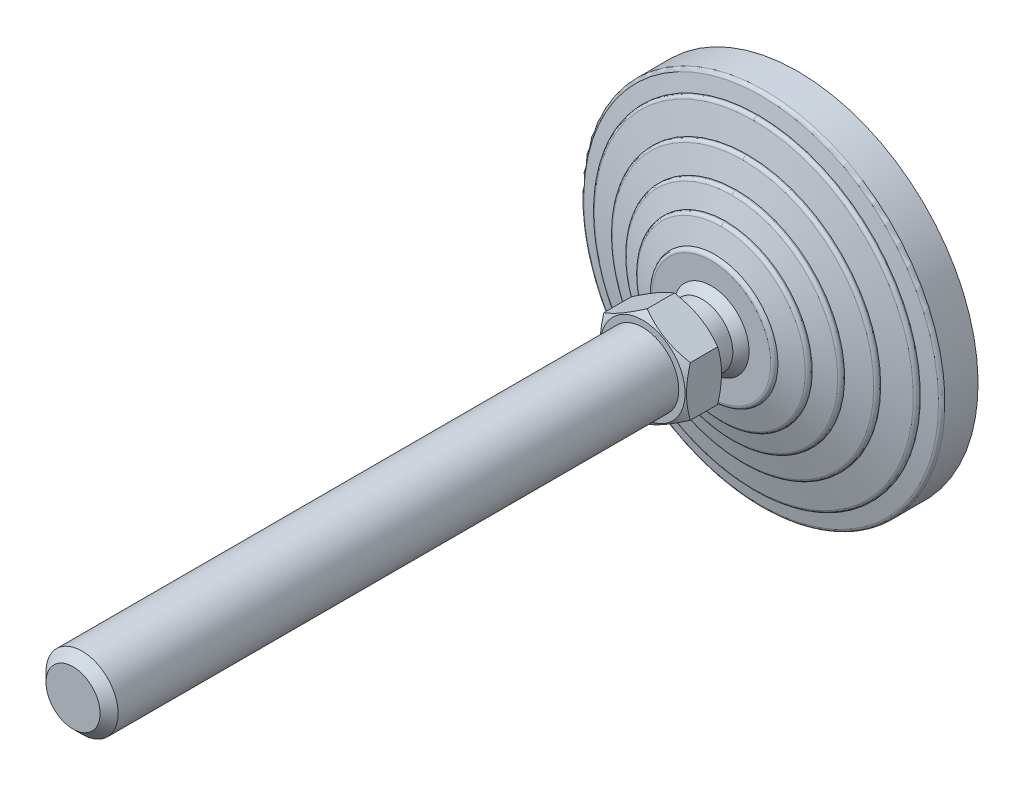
ISO-10303-21;
HEADER;
FILE_DESCRIPTION(('STEP AP214'),'2;1');
FILE_NAME('part.step','',(''),(''),'','','');
FILE_SCHEMA(('AUTOMOTIVE_DESIGN { 1 0 10303 214 1 1 1 1 }'));
ENDSEC;
DATA;
#1=APPLICATION_CONTEXT('core data for automotive mechanical design processes');
#2=APPLICATION_PROTOCOL_DEFINITION('international standard','automotive_design',2000,#1);
#3=PRODUCT_CONTEXT('',#1,'mechanical');
#4=PRODUCT('Part','Part','',(#3));
#5=PRODUCT_RELATED_PRODUCT_CATEGORY('part','',(#4));
#6=PRODUCT_DEFINITION_FORMATION('','',#4);
#7=PRODUCT_DEFINITION_CONTEXT('part definition',#1,'design');
#8=PRODUCT_DEFINITION('design','',#6,#7);
#9=PRODUCT_DEFINITION_SHAPE('','',#8);
#10=(LENGTH_UNIT() NAMED_UNIT(*) SI_UNIT(.MILLI.,.METRE.));
#11=(NAMED_UNIT(*) PLANE_ANGLE_UNIT() SI_UNIT($,.RADIAN.));
#12=(NAMED_UNIT(*) SI_UNIT($,.STERADIAN.) SOLID_ANGLE_UNIT());
#13=UNCERTAINTY_MEASURE_WITH_UNIT(LENGTH_MEASURE(1.E-05),#10,'distance_accuracy_value','');
#14=(GEOMETRIC_REPRESENTATION_CONTEXT(3) GLOBAL_UNCERTAINTY_ASSIGNED_CONTEXT((#13)) GLOBAL_UNIT_ASSIGNED_CONTEXT((#10,
#11,#12)) REPRESENTATION_CONTEXT('',''));
#15=CARTESIAN_POINT('',(0.,0.,0.));
#16=DIRECTION('',(0.,0.,1.));
#17=DIRECTION('',(1.,0.,0.));
#18=AXIS2_PLACEMENT_3D('',#15,#16,#17);
#19=CARTESIAN_POINT('',(-44.173478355,44.022,0.));
#20=DIRECTION('',(0.,0.,1.));
#21=DIRECTION('',(0.,-1.,0.));
#22=AXIS2_PLACEMENT_3D('',#19,#20,#21);
#23=PLANE('',#22);
#24=CARTESIAN_POINT('',(0.,0.,0.));
#25=DIRECTION('',(0.,0.,-1.));
#26=DIRECTION('',(0.,1.,0.));
#27=AXIS2_PLACEMENT_3D('',#24,#25,#26);
#28=CIRCLE('',#27,43.5);
#29=CARTESIAN_POINT('',(0.,43.5,0.));
#30=VERTEX_POINT('',#29);
#31=EDGE_CURVE('E174',#30,#30,#28,.F.);
#32=ORIENTED_EDGE('',*,*,#31,.F.);
#33=EDGE_LOOP('',(#32));
#34=FACE_BOUND('',#33,.T.);
#35=ADVANCED_FACE('F14',(#34),#23,.F.);
#36=CARTESIAN_POINT('',(0.,0.,3.));
#37=DIRECTION('',(0.,0.,-1.));
#38=DIRECTION('',(0.,1.,0.));
#39=AXIS2_PLACEMENT_3D('',#36,#37,#38);
#40=CYLINDRICAL_SURFACE('',#39,43.5);
#41=ORIENTED_EDGE('',*,*,#31,.T.);
#42=EDGE_LOOP('',(#41));
#43=FACE_BOUND('',#42,.T.);
#44=CARTESIAN_POINT('',(0.,0.,3.));
#45=DIRECTION('',(0.,0.,-1.));
#46=DIRECTION('',(0.,1.,0.));
#47=AXIS2_PLACEMENT_3D('',#44,#45,#46);
#48=CIRCLE('',#47,43.5);
#49=CARTESIAN_POINT('',(0.,43.5,3.));
#50=VERTEX_POINT('',#49);
#51=EDGE_CURVE('E172',#50,#50,#48,.T.);
#52=ORIENTED_EDGE('',*,*,#51,.T.);
#53=EDGE_LOOP('',(#52));
#54=FACE_BOUND('',#53,.T.);
#55=ADVANCED_FACE('F326',(#43,#54),#40,.T.);
#56=CARTESIAN_POINT('',(-50.774113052,50.6,3.));
#57=DIRECTION('',(0.,0.,1.));
#58=DIRECTION('',(0.,-1.,0.));
#59=AXIS2_PLACEMENT_3D('',#56,#57,#58);
#60=PLANE('',#59);
#61=ORIENTED_EDGE('',*,*,#51,.F.);
#62=EDGE_LOOP('',(#61));
#63=FACE_BOUND('',#62,.T.);
#64=CARTESIAN_POINT('',(0.,0.,3.));
#65=DIRECTION('',(0.,0.,-1.));
#66=DIRECTION('',(0.,1.,0.));
#67=AXIS2_PLACEMENT_3D('',#64,#65,#66);
#68=CIRCLE('',#67,50.);
#69=CARTESIAN_POINT('',(0.,50.,3.));
#70=VERTEX_POINT('',#69);
#71=EDGE_CURVE('E168',#70,#70,#68,.F.);
#72=ORIENTED_EDGE('',*,*,#71,.F.);
#73=EDGE_LOOP('',(#72));
#74=FACE_BOUND('',#73,.T.);
#75=ADVANCED_FACE('F323',(#63,#74),#60,.F.);
#76=CARTESIAN_POINT('',(0.,0.,12.180196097));
#77=DIRECTION('',(0.,0.,-1.));
#78=DIRECTION('',(0.,1.,0.));
#79=AXIS2_PLACEMENT_3D('',#76,#77,#78);
#80=CYLINDRICAL_SURFACE('',#79,50.);
#81=ORIENTED_EDGE('',*,*,#71,.T.);
#82=EDGE_LOOP('',(#81));
#83=FACE_BOUND('',#82,.T.);
#84=CARTESIAN_POINT('',(0.,0.,12.180196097));
#85=DIRECTION('',(0.,0.,1.));
#86=DIRECTION('',(0.,-1.,0.));
#87=AXIS2_PLACEMENT_3D('',#84,#85,#86);
#88=CIRCLE('',#87,50.);
#89=CARTESIAN_POINT('',(0.,-50.,12.180196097));
#90=VERTEX_POINT('',#89);
#91=EDGE_CURVE('E171',#90,#90,#88,.T.);
#92=ORIENTED_EDGE('',*,*,#91,.F.);
#93=EDGE_LOOP('',(#92));
#94=FACE_BOUND('',#93,.T.);
#95=ADVANCED_FACE('F321',(#83,#94),#80,.T.);
#96=CARTESIAN_POINT('',(0.,0.,12.180196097));
#97=DIRECTION('',(0.,0.,-1.));
#98=DIRECTION('',(0.,1.,0.));
#99=AXIS2_PLACEMENT_3D('',#96,#97,#98);
#100=TOROIDAL_SURFACE('',#99,48.9999999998,1.00000000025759);
#101=ORIENTED_EDGE('',*,*,#91,.T.);
#102=EDGE_LOOP('',(#101));
#103=FACE_BOUND('',#102,.T.);
#104=CARTESIAN_POINT('',(0.,0.,13.160776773));
#105=DIRECTION('',(0.,0.,-1.));
#106=DIRECTION('',(0.,1.,0.));
#107=AXIS2_PLACEMENT_3D('',#104,#105,#106);
#108=CIRCLE('',#107,49.196116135);
#109=CARTESIAN_POINT('',(0.,49.196116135,13.160776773));
#110=VERTEX_POINT('',#109);
#111=EDGE_CURVE('E477',#110,#110,#108,.F.);
#112=ORIENTED_EDGE('',*,*,#111,.F.);
#113=EDGE_LOOP('',(#112));
#114=FACE_BOUND('',#113,.T.);
#115=ADVANCED_FACE('F317',(#103,#114),#100,.T.);
#116=CARTESIAN_POINT('',(0.,0.,14.));
#117=DIRECTION('',(0.,0.,-1.));
#118=DIRECTION('',(1.,0.,0.));
#119=AXIS2_PLACEMENT_3D('',#116,#117,#118);
#120=CONICAL_SURFACE('',#119,45.,1.37340076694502);
#121=ORIENTED_EDGE('',*,*,#111,.T.);
#122=EDGE_LOOP('',(#121));
#123=FACE_BOUND('',#122,.T.);
#124=CARTESIAN_POINT('',(0.,0.,14.));
#125=DIRECTION('',(0.,0.,-1.));
#126=DIRECTION('',(0.,1.,0.));
#127=AXIS2_PLACEMENT_3D('',#124,#125,#126);
#128=CIRCLE('',#127,45.);
#129=CARTESIAN_POINT('',(0.,45.,14.));
#130=VERTEX_POINT('',#129);
#131=EDGE_CURVE('E480',#130,#130,#128,.F.);
#132=ORIENTED_EDGE('',*,*,#131,.F.);
#133=EDGE_LOOP('',(#132));
#134=FACE_BOUND('',#133,.T.);
#135=ADVANCED_FACE('F320',(#123,#134),#120,.T.);
#136=CARTESIAN_POINT('',(0.,0.,14.219223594));
#137=DIRECTION('',(0.,0.,-1.));
#138=DIRECTION('',(1.,0.,0.));
#139=AXIS2_PLACEMENT_3D('',#136,#137,#138);
#140=CYLINDRICAL_SURFACE('',#139,45.);
#141=ORIENTED_EDGE('',*,*,#131,.T.);
#142=EDGE_LOOP('',(#141));
#143=FACE_BOUND('',#142,.T.);
#144=CARTESIAN_POINT('',(0.,0.,14.219223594));
#145=DIRECTION('',(0.,0.,1.));
#146=DIRECTION('',(-1.,0.,0.));
#147=AXIS2_PLACEMENT_3D('',#144,#145,#146);
#148=CIRCLE('',#147,45.);
#149=CARTESIAN_POINT('',(-4.61482714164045E-09,-45.,14.219223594));
#150=VERTEX_POINT('',#149);
#151=CARTESIAN_POINT('',(0.,45.,14.219223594));
#152=VERTEX_POINT('',#151);
#153=EDGE_CURVE('E650',#150,#152,#148,.T.);
#154=ORIENTED_EDGE('',*,*,#153,.F.);
#155=CARTESIAN_POINT('',(0.,0.,14.219223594));
#156=DIRECTION('',(0.,0.,1.));
#157=DIRECTION('',(-1.,0.,0.));
#158=AXIS2_PLACEMENT_3D('',#155,#156,#157);
#159=CIRCLE('',#158,45.);
#160=EDGE_CURVE('E661',#152,#150,#159,.T.);
#161=ORIENTED_EDGE('',*,*,#160,.F.);
#162=EDGE_LOOP('',(#154,#161));
#163=FACE_BOUND('',#162,.T.);
#164=ADVANCED_FACE('F451',(#143,#163),#140,.T.);
#165=CARTESIAN_POINT('',(0.,-45.,14.219223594));
#166=CARTESIAN_POINT('',(-90.0000000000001,-45.,14.219223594));
#167=CARTESIAN_POINT('',(-90.0000000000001,45.,14.219223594));
#168=CARTESIAN_POINT('',(0.,45.,14.219223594));
#169=CARTESIAN_POINT('',(0.,-45.,14.696951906));
#170=CARTESIAN_POINT('',(-90.0000000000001,-45.,14.696951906));
#171=CARTESIAN_POINT('',(-90.0000000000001,45.,14.696951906));
#172=CARTESIAN_POINT('',(0.,45.,14.696951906));
#173=CARTESIAN_POINT('',(0.,-44.706000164,15.073499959));
#174=CARTESIAN_POINT('',(-89.412000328,-44.706000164,15.073499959));
#175=CARTESIAN_POINT('',(-89.412000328,44.706000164,15.073499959));
#176=CARTESIAN_POINT('',(0.,44.706000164,15.073499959));
#177=CARTESIAN_POINT('',(0.,-44.242535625,15.189366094));
#178=CARTESIAN_POINT('',(-88.4850712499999,-44.2425356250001,15.189366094));
#179=CARTESIAN_POINT('',(-88.4850712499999,44.2425356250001,15.189366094));
#180=CARTESIAN_POINT('',(0.,44.242535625,15.189366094));
#181=(BOUNDED_SURFACE() B_SPLINE_SURFACE(3,3,((#165,#166,#167,#168),(#169,#170,#171,#172),(#173,
#174,#175,#176),(#177,#178,#179,#180)),.UNSPECIFIED.,.F.,.F.,
.F.) B_SPLINE_SURFACE_WITH_KNOTS((4,4),(4,4),(0.,1.),(0.,1.),
.UNSPECIFIED.) GEOMETRIC_REPRESENTATION_ITEM() RATIONAL_B_SPLINE_SURFACE(((1.,0.333333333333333,
0.333333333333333,1.),(0.858803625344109,0.286267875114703,0.286267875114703,0.858803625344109),
(0.858803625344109,0.286267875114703,0.286267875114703,0.858803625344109),(1.,0.333333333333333,
0.333333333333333,1.))) REPRESENTATION_ITEM('') SURFACE());
#182=CARTESIAN_POINT('',(0.,45.,14.219223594));
#183=CARTESIAN_POINT('',(0.,45.,14.696951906));
#184=CARTESIAN_POINT('',(0.,44.706000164,15.073499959));
#185=CARTESIAN_POINT('',(0.,44.242535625,15.189366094));
#186=(BOUNDED_CURVE() B_SPLINE_CURVE(3,(#182,#183,#184,#185),.UNSPECIFIED.,.F.,
.F.) B_SPLINE_CURVE_WITH_KNOTS((4,4),(0.,1.),
.UNSPECIFIED.) CURVE() GEOMETRIC_REPRESENTATION_ITEM() RATIONAL_B_SPLINE_CURVE((1.,
0.858803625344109,0.858803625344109,1.)) REPRESENTATION_ITEM(''));
#187=CARTESIAN_POINT('',(0.,44.2425356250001,15.1893660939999));
#188=VERTEX_POINT('',#187);
#189=EDGE_CURVE('E641',#152,#188,#186,.T.);
#190=CARTESIAN_POINT('',(0.,-45.,14.219223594));
#191=CARTESIAN_POINT('',(0.,-45.,14.696951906));
#192=CARTESIAN_POINT('',(0.,-44.706000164,15.073499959));
#193=CARTESIAN_POINT('',(0.,-44.242535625,15.189366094));
#194=(BOUNDED_CURVE() B_SPLINE_CURVE(3,(#190,#191,#192,#193),.UNSPECIFIED.,.F.,
.F.) B_SPLINE_CURVE_WITH_KNOTS((4,4),(0.,1.),
.UNSPECIFIED.) CURVE() GEOMETRIC_REPRESENTATION_ITEM() RATIONAL_B_SPLINE_CURVE((1.,
0.858803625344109,0.858803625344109,1.)) REPRESENTATION_ITEM(''));
#195=CARTESIAN_POINT('',(-1.3611443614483E-08,-44.2425356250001,15.1893660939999));
#196=VERTEX_POINT('',#195);
#197=EDGE_CURVE('E655',#196,#150,#194,.F.);
#198=CARTESIAN_POINT('',(0.,0.,15.1893660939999));
#199=DIRECTION('',(0.,0.,-1.));
#200=DIRECTION('',(0.,1.,0.));
#201=AXIS2_PLACEMENT_3D('',#198,#199,#200);
#202=CIRCLE('',#201,44.242535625);
#203=EDGE_CURVE('E638',#188,#196,#202,.F.);
#204=ORIENTED_EDGE('',*,*,#189,.F.);
#205=ORIENTED_EDGE('',*,*,#160,.T.);
#206=ORIENTED_EDGE('',*,*,#197,.F.);
#207=ORIENTED_EDGE('',*,*,#203,.F.);
#208=EDGE_LOOP('',(#204,#205,#206,#207));
#209=FACE_BOUND('',#208,.T.);
#210=ADVANCED_FACE('F440',(#209),#181,.T.);
#211=CARTESIAN_POINT('',(0.,45.,14.219223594));
#212=CARTESIAN_POINT('',(90.0000000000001,45.,14.219223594));
#213=CARTESIAN_POINT('',(90.0000000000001,-45.,14.219223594));
#214=CARTESIAN_POINT('',(0.,-45.,14.219223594));
#215=CARTESIAN_POINT('',(0.,45.,14.696951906));
#216=CARTESIAN_POINT('',(90.0000000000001,45.,14.696951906));
#217=CARTESIAN_POINT('',(90.0000000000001,-45.,14.696951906));
#218=CARTESIAN_POINT('',(0.,-45.,14.696951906));
#219=CARTESIAN_POINT('',(0.,44.706000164,15.073499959));
#220=CARTESIAN_POINT('',(89.412000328,44.706000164,15.073499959));
#221=CARTESIAN_POINT('',(89.412000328,-44.706000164,15.073499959));
#222=CARTESIAN_POINT('',(0.,-44.706000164,15.073499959));
#223=CARTESIAN_POINT('',(0.,44.242535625,15.189366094));
#224=CARTESIAN_POINT('',(88.4850712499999,44.2425356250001,15.189366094));
#225=CARTESIAN_POINT('',(88.4850712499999,-44.2425356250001,15.189366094));
#226=CARTESIAN_POINT('',(0.,-44.242535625,15.189366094));
#227=(BOUNDED_SURFACE() B_SPLINE_SURFACE(3,3,((#211,#212,#213,#214),(#215,#216,#217,#218),(#219,
#220,#221,#222),(#223,#224,#225,#226)),.UNSPECIFIED.,.F.,.F.,
.F.) B_SPLINE_SURFACE_WITH_KNOTS((4,4),(4,4),(0.,1.),(0.,1.),
.UNSPECIFIED.) GEOMETRIC_REPRESENTATION_ITEM() RATIONAL_B_SPLINE_SURFACE(((1.,0.333333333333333,
0.333333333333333,1.),(0.858803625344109,0.286267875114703,0.286267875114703,0.858803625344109),
(0.858803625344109,0.286267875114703,0.286267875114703,0.858803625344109),(1.,0.333333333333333,
0.333333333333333,1.))) REPRESENTATION_ITEM('') SURFACE());
#228=CARTESIAN_POINT('',(0.,0.,15.1893660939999));
#229=DIRECTION('',(0.,0.,-1.));
#230=DIRECTION('',(0.,1.,0.));
#231=AXIS2_PLACEMENT_3D('',#228,#229,#230);
#232=CIRCLE('',#231,44.242535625);
#233=EDGE_CURVE('E637',#196,#188,#232,.F.);
#234=ORIENTED_EDGE('',*,*,#153,.T.);
#235=ORIENTED_EDGE('',*,*,#189,.T.);
#236=ORIENTED_EDGE('',*,*,#233,.F.);
#237=ORIENTED_EDGE('',*,*,#197,.T.);
#238=EDGE_LOOP('',(#234,#235,#236,#237));
#239=FACE_BOUND('',#238,.T.);
#240=ADVANCED_FACE('F434',(#239),#227,.T.);
#241=CARTESIAN_POINT('',(0.,0.,17.));
#242=DIRECTION('',(0.,0.,-1.));
#243=DIRECTION('',(0.,1.,0.));
#244=AXIS2_PLACEMENT_3D('',#241,#242,#243);
#245=CONICAL_SURFACE('',#244,37.,1.32581766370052);
#246=ORIENTED_EDGE('',*,*,#203,.T.);
#247=ORIENTED_EDGE('',*,*,#233,.T.);
#248=EDGE_LOOP('',(#246,#247));
#249=FACE_BOUND('',#248,.T.);
#250=CARTESIAN_POINT('',(0.,0.,17.));
#251=DIRECTION('',(0.,0.,-1.));
#252=DIRECTION('',(0.,1.,0.));
#253=AXIS2_PLACEMENT_3D('',#250,#251,#252);
#254=CIRCLE('',#253,37.);
#255=CARTESIAN_POINT('',(0.,37.,17.));
#256=VERTEX_POINT('',#255);
#257=EDGE_CURVE('E628',#256,#256,#254,.F.);
#258=ORIENTED_EDGE('',*,*,#257,.F.);
#259=EDGE_LOOP('',(#258));
#260=FACE_BOUND('',#259,.T.);
#261=ADVANCED_FACE('F430',(#249,#260),#245,.T.);
#262=CARTESIAN_POINT('',(0.,0.,17.245698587));
#263=DIRECTION('',(0.,0.,-1.));
#264=DIRECTION('',(1.,0.,0.));
#265=AXIS2_PLACEMENT_3D('',#262,#263,#264);
#266=CYLINDRICAL_SURFACE('',#265,37.);
#267=ORIENTED_EDGE('',*,*,#257,.T.);
#268=EDGE_LOOP('',(#267));
#269=FACE_BOUND('',#268,.T.);
#270=CARTESIAN_POINT('',(0.,0.,17.245698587));
#271=DIRECTION('',(0.,0.,1.));
#272=DIRECTION('',(0.,-1.,0.));
#273=AXIS2_PLACEMENT_3D('',#270,#271,#272);
#274=CIRCLE('',#273,37.);
#275=CARTESIAN_POINT('',(-3.79441342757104E-09,-37.,17.245698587));
#276=VERTEX_POINT('',#275);
#277=CARTESIAN_POINT('',(0.,37.,17.245698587));
#278=VERTEX_POINT('',#277);
#279=EDGE_CURVE('E608',#276,#278,#274,.T.);
#280=ORIENTED_EDGE('',*,*,#279,.F.);
#281=CARTESIAN_POINT('',(0.,0.,17.245698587));
#282=DIRECTION('',(0.,0.,1.));
#283=DIRECTION('',(0.,-1.,0.));
#284=AXIS2_PLACEMENT_3D('',#281,#282,#283);
#285=CIRCLE('',#284,37.);
#286=EDGE_CURVE('E619',#278,#276,#285,.T.);
#287=ORIENTED_EDGE('',*,*,#286,.F.);
#288=EDGE_LOOP('',(#280,#287));
#289=FACE_BOUND('',#288,.T.);
#290=ADVANCED_FACE('F421',(#269,#289),#266,.T.);
#291=CARTESIAN_POINT('',(0.,-37.,17.245698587));
#292=CARTESIAN_POINT('',(-74.,-37.,17.245698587));
#293=CARTESIAN_POINT('',(-74.,37.,17.245698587));
#294=CARTESIAN_POINT('',(0.,37.,17.245698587));
#295=CARTESIAN_POINT('',(0.,-37.,17.709515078));
#296=CARTESIAN_POINT('',(-73.9999999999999,-37.,17.709515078));
#297=CARTESIAN_POINT('',(-73.9999999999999,37.,17.709515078));
#298=CARTESIAN_POINT('',(0.,37.,17.709515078));
#299=CARTESIAN_POINT('',(0.,-36.720691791,18.079802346));
#300=CARTESIAN_POINT('',(-73.441383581,-36.720691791,18.079802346));
#301=CARTESIAN_POINT('',(-73.441383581,36.720691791,18.079802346));
#302=CARTESIAN_POINT('',(0.,36.720691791,18.079802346));
#303=CARTESIAN_POINT('',(0.,-36.274721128,18.207222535));
#304=CARTESIAN_POINT('',(-72.549442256,-36.274721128,18.207222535));
#305=CARTESIAN_POINT('',(-72.549442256,36.274721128,18.207222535));
#306=CARTESIAN_POINT('',(0.,36.274721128,18.207222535));
#307=(BOUNDED_SURFACE() B_SPLINE_SURFACE(3,3,((#291,#292,#293,#294),(#295,#296,#297,#298),(#299,
#300,#301,#302),(#303,#304,#305,#306)),.UNSPECIFIED.,.F.,.F.,
.F.) B_SPLINE_SURFACE_WITH_KNOTS((4,4),(4,4),(0.,1.),(0.,1.),
.UNSPECIFIED.) GEOMETRIC_REPRESENTATION_ITEM() RATIONAL_B_SPLINE_SURFACE(((1.,0.333333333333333,
0.333333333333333,1.),(0.865565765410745,0.288521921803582,0.288521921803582,0.865565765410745),
(0.865565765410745,0.288521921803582,0.288521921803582,0.865565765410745),(1.,0.333333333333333,
0.333333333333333,1.))) REPRESENTATION_ITEM('') SURFACE());
#308=CARTESIAN_POINT('',(0.,37.,17.245698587));
#309=CARTESIAN_POINT('',(0.,37.,17.709515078));
#310=CARTESIAN_POINT('',(0.,36.720691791,18.079802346));
#311=CARTESIAN_POINT('',(0.,36.274721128,18.207222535));
#312=(BOUNDED_CURVE() B_SPLINE_CURVE(3,(#308,#309,#310,#311),.UNSPECIFIED.,.F.,
.F.) B_SPLINE_CURVE_WITH_KNOTS((4,4),(0.,1.),
.UNSPECIFIED.) CURVE() GEOMETRIC_REPRESENTATION_ITEM() RATIONAL_B_SPLINE_CURVE((1.,
0.865565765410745,0.865565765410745,1.)) REPRESENTATION_ITEM(''));
#313=CARTESIAN_POINT('',(0.,36.2747211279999,18.207222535));
#314=VERTEX_POINT('',#313);
#315=EDGE_CURVE('E599',#278,#314,#312,.T.);
#316=CARTESIAN_POINT('',(0.,-37.,17.245698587));
#317=CARTESIAN_POINT('',(0.,-37.,17.709515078));
#318=CARTESIAN_POINT('',(0.,-36.720691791,18.079802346));
#319=CARTESIAN_POINT('',(0.,-36.274721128,18.207222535));
#320=(BOUNDED_CURVE() B_SPLINE_CURVE(3,(#316,#317,#318,#319),.UNSPECIFIED.,.F.,
.F.) B_SPLINE_CURVE_WITH_KNOTS((4,4),(0.,1.),
.UNSPECIFIED.) CURVE() GEOMETRIC_REPRESENTATION_ITEM() RATIONAL_B_SPLINE_CURVE((1.,
0.865565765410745,0.865565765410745,1.)) REPRESENTATION_ITEM(''));
#321=CARTESIAN_POINT('',(-1.11601045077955E-08,-36.2747211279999,18.207222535));
#322=VERTEX_POINT('',#321);
#323=EDGE_CURVE('E613',#322,#276,#320,.F.);
#324=CARTESIAN_POINT('',(0.,0.,18.207222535));
#325=DIRECTION('',(0.,0.,-1.));
#326=DIRECTION('',(0.,1.,0.));
#327=AXIS2_PLACEMENT_3D('',#324,#325,#326);
#328=CIRCLE('',#327,36.274721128);
#329=EDGE_CURVE('E596',#314,#322,#328,.F.);
#330=ORIENTED_EDGE('',*,*,#315,.F.);
#331=ORIENTED_EDGE('',*,*,#286,.T.);
#332=ORIENTED_EDGE('',*,*,#323,.F.);
#333=ORIENTED_EDGE('',*,*,#329,.F.);
#334=EDGE_LOOP('',(#330,#331,#332,#333));
#335=FACE_BOUND('',#334,.T.);
#336=ADVANCED_FACE('F410',(#335),#307,.T.);
#337=CARTESIAN_POINT('',(0.,37.,17.245698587));
#338=CARTESIAN_POINT('',(74.,37.,17.245698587));
#339=CARTESIAN_POINT('',(74.,-37.,17.245698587));
#340=CARTESIAN_POINT('',(0.,-37.,17.245698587));
#341=CARTESIAN_POINT('',(0.,37.,17.709515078));
#342=CARTESIAN_POINT('',(73.9999999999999,37.,17.709515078));
#343=CARTESIAN_POINT('',(73.9999999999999,-37.,17.709515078));
#344=CARTESIAN_POINT('',(0.,-37.,17.709515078));
#345=CARTESIAN_POINT('',(0.,36.720691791,18.079802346));
#346=CARTESIAN_POINT('',(73.441383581,36.720691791,18.079802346));
#347=CARTESIAN_POINT('',(73.441383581,-36.720691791,18.079802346));
#348=CARTESIAN_POINT('',(0.,-36.720691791,18.079802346));
#349=CARTESIAN_POINT('',(0.,36.274721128,18.207222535));
#350=CARTESIAN_POINT('',(72.549442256,36.274721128,18.207222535));
#351=CARTESIAN_POINT('',(72.549442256,-36.274721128,18.207222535));
#352=CARTESIAN_POINT('',(0.,-36.274721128,18.207222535));
#353=(BOUNDED_SURFACE() B_SPLINE_SURFACE(3,3,((#337,#338,#339,#340),(#341,#342,#343,#344),(#345,
#346,#347,#348),(#349,#350,#351,#352)),.UNSPECIFIED.,.F.,.F.,
.F.) B_SPLINE_SURFACE_WITH_KNOTS((4,4),(4,4),(0.,1.),(0.,1.),
.UNSPECIFIED.) GEOMETRIC_REPRESENTATION_ITEM() RATIONAL_B_SPLINE_SURFACE(((1.,0.333333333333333,
0.333333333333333,1.),(0.865565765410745,0.288521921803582,0.288521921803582,0.865565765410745),
(0.865565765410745,0.288521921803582,0.288521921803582,0.865565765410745),(1.,0.333333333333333,
0.333333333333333,1.))) REPRESENTATION_ITEM('') SURFACE());
#354=CARTESIAN_POINT('',(0.,0.,18.207222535));
#355=DIRECTION('',(0.,0.,-1.));
#356=DIRECTION('',(0.,1.,0.));
#357=AXIS2_PLACEMENT_3D('',#354,#355,#356);
#358=CIRCLE('',#357,36.274721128);
#359=EDGE_CURVE('E595',#322,#314,#358,.F.);
#360=ORIENTED_EDGE('',*,*,#279,.T.);
#361=ORIENTED_EDGE('',*,*,#315,.T.);
#362=ORIENTED_EDGE('',*,*,#359,.F.);
#363=ORIENTED_EDGE('',*,*,#323,.T.);
#364=EDGE_LOOP('',(#360,#361,#362,#363));
#365=FACE_BOUND('',#364,.T.);
#366=ADVANCED_FACE('F404',(#365),#353,.T.);
#367=CARTESIAN_POINT('',(0.,0.,20.));
#368=DIRECTION('',(0.,0.,-1.));
#369=DIRECTION('',(1.,0.,0.));
#370=AXIS2_PLACEMENT_3D('',#367,#368,#369);
#371=CONICAL_SURFACE('',#370,30.,1.29249666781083);
#372=ORIENTED_EDGE('',*,*,#329,.T.);
#373=ORIENTED_EDGE('',*,*,#359,.T.);
#374=EDGE_LOOP('',(#372,#373));
#375=FACE_BOUND('',#374,.T.);
#376=CARTESIAN_POINT('',(0.,0.,20.));
#377=DIRECTION('',(0.,0.,-1.));
#378=DIRECTION('',(0.,1.,0.));
#379=AXIS2_PLACEMENT_3D('',#376,#377,#378);
#380=CIRCLE('',#379,30.);
#381=CARTESIAN_POINT('',(0.,30.,20.));
#382=VERTEX_POINT('',#381);
#383=EDGE_CURVE('E586',#382,#382,#380,.F.);
#384=ORIENTED_EDGE('',*,*,#383,.F.);
#385=EDGE_LOOP('',(#384));
#386=FACE_BOUND('',#385,.T.);
#387=ADVANCED_FACE('F400',(#375,#386),#371,.T.);
#388=CARTESIAN_POINT('',(0.,0.,20.27924078));
#389=DIRECTION('',(0.,0.,-1.));
#390=DIRECTION('',(0.,1.,0.));
#391=AXIS2_PLACEMENT_3D('',#388,#389,#390);
#392=CYLINDRICAL_SURFACE('',#391,30.);
#393=ORIENTED_EDGE('',*,*,#383,.T.);
#394=EDGE_LOOP('',(#393));
#395=FACE_BOUND('',#394,.T.);
#396=CARTESIAN_POINT('',(0.,0.,20.27924078));
#397=DIRECTION('',(0.,0.,1.));
#398=DIRECTION('',(0.,-1.,0.));
#399=AXIS2_PLACEMENT_3D('',#396,#397,#398);
#400=CIRCLE('',#399,30.);
#401=CARTESIAN_POINT('',(-3.0765514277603E-09,-30.,20.27924078));
#402=VERTEX_POINT('',#401);
#403=CARTESIAN_POINT('',(0.,30.,20.27924078));
#404=VERTEX_POINT('',#403);
#405=EDGE_CURVE('E566',#402,#404,#400,.T.);
#406=ORIENTED_EDGE('',*,*,#405,.F.);
#407=CARTESIAN_POINT('',(0.,0.,20.27924078));
#408=DIRECTION('',(0.,0.,1.));
#409=DIRECTION('',(0.,-1.,0.));
#410=AXIS2_PLACEMENT_3D('',#407,#408,#409);
#411=CIRCLE('',#410,30.);
#412=EDGE_CURVE('E577',#404,#402,#411,.T.);
#413=ORIENTED_EDGE('',*,*,#412,.F.);
#414=EDGE_LOOP('',(#406,#413));
#415=FACE_BOUND('',#414,.T.);
#416=ADVANCED_FACE('F391',(#395,#415),#392,.T.);
#417=CARTESIAN_POINT('',(0.,-30.,20.27924078));
#418=CARTESIAN_POINT('',(-60.0000000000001,-30.,20.27924078));
#419=CARTESIAN_POINT('',(-60.0000000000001,30.,20.27924078));
#420=CARTESIAN_POINT('',(0.,30.,20.27924078));
#421=CARTESIAN_POINT('',(0.,-30.,20.725161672));
#422=CARTESIAN_POINT('',(-60.0000000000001,-30.,20.725161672));
#423=CARTESIAN_POINT('',(-60.0000000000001,30.,20.725161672));
#424=CARTESIAN_POINT('',(0.,30.,20.725161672));
#425=CARTESIAN_POINT('',(0.,-29.739265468,21.086911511));
#426=CARTESIAN_POINT('',(-59.4785309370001,-29.739265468,21.086911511));
#427=CARTESIAN_POINT('',(-59.4785309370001,29.739265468,21.086911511));
#428=CARTESIAN_POINT('',(0.,29.739265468,21.086911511));
#429=CARTESIAN_POINT('',(0.,-29.316227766,21.227924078));
#430=CARTESIAN_POINT('',(-58.6324555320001,-29.316227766,21.227924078));
#431=CARTESIAN_POINT('',(-58.6324555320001,29.316227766,21.227924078));
#432=CARTESIAN_POINT('',(0.,29.316227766,21.227924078));
#433=(BOUNDED_SURFACE() B_SPLINE_SURFACE(3,3,((#417,#418,#419,#420),(#421,#422,#423,#424),(#425,
#426,#427,#428),(#429,#430,#431,#432)),.UNSPECIFIED.,.F.,.F.,
.F.) B_SPLINE_SURFACE_WITH_KNOTS((4,4),(4,4),(0.,1.),(0.,1.),
.UNSPECIFIED.) GEOMETRIC_REPRESENTATION_ITEM() RATIONAL_B_SPLINE_SURFACE(((1.,0.333333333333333,
0.333333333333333,1.),(0.874161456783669,0.291387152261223,0.291387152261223,0.874161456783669),
(0.874161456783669,0.291387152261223,0.291387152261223,0.874161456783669),(1.,0.333333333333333,
0.333333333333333,1.))) REPRESENTATION_ITEM('') SURFACE());
#434=CARTESIAN_POINT('',(0.,30.,20.27924078));
#435=CARTESIAN_POINT('',(0.,30.,20.725161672));
#436=CARTESIAN_POINT('',(0.,29.739265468,21.086911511));
#437=CARTESIAN_POINT('',(0.,29.316227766,21.227924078));
#438=(BOUNDED_CURVE() B_SPLINE_CURVE(3,(#434,#435,#436,#437),.UNSPECIFIED.,.F.,
.F.) B_SPLINE_CURVE_WITH_KNOTS((4,4),(0.,1.),
.UNSPECIFIED.) CURVE() GEOMETRIC_REPRESENTATION_ITEM() RATIONAL_B_SPLINE_CURVE((1.,
0.874161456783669,0.874161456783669,1.)) REPRESENTATION_ITEM(''));
#439=CARTESIAN_POINT('',(0.,29.316227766,21.227924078));
#440=VERTEX_POINT('',#439);
#441=EDGE_CURVE('E557',#404,#440,#438,.T.);
#442=CARTESIAN_POINT('',(0.,-30.,20.27924078));
#443=CARTESIAN_POINT('',(0.,-30.,20.725161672));
#444=CARTESIAN_POINT('',(0.,-29.739265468,21.086911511));
#445=CARTESIAN_POINT('',(0.,-29.316227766,21.227924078));
#446=(BOUNDED_CURVE() B_SPLINE_CURVE(3,(#442,#443,#444,#445),.UNSPECIFIED.,.F.,
.F.) B_SPLINE_CURVE_WITH_KNOTS((4,4),(0.,1.),
.UNSPECIFIED.) CURVE() GEOMETRIC_REPRESENTATION_ITEM() RATIONAL_B_SPLINE_CURVE((1.,
0.874161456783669,0.874161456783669,1.)) REPRESENTATION_ITEM(''));
#447=CARTESIAN_POINT('',(-9.01928823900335E-09,-29.316227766,21.227924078));
#448=VERTEX_POINT('',#447);
#449=EDGE_CURVE('E571',#448,#402,#446,.F.);
#450=CARTESIAN_POINT('',(0.,0.,21.227924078));
#451=DIRECTION('',(0.,0.,-1.));
#452=DIRECTION('',(0.,1.,0.));
#453=AXIS2_PLACEMENT_3D('',#450,#451,#452);
#454=CIRCLE('',#453,29.316227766);
#455=EDGE_CURVE('E554',#440,#448,#454,.F.);
#456=ORIENTED_EDGE('',*,*,#441,.F.);
#457=ORIENTED_EDGE('',*,*,#412,.T.);
#458=ORIENTED_EDGE('',*,*,#449,.F.);
#459=ORIENTED_EDGE('',*,*,#455,.F.);
#460=EDGE_LOOP('',(#456,#457,#458,#459));
#461=FACE_BOUND('',#460,.T.);
#462=ADVANCED_FACE('F380',(#461),#433,.T.);
#463=CARTESIAN_POINT('',(0.,30.,20.27924078));
#464=CARTESIAN_POINT('',(60.0000000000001,30.,20.27924078));
#465=CARTESIAN_POINT('',(60.0000000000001,-30.,20.27924078));
#466=CARTESIAN_POINT('',(0.,-30.,20.27924078));
#467=CARTESIAN_POINT('',(0.,30.,20.725161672));
#468=CARTESIAN_POINT('',(60.0000000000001,30.,20.725161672));
#469=CARTESIAN_POINT('',(60.0000000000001,-30.,20.725161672));
#470=CARTESIAN_POINT('',(0.,-30.,20.725161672));
#471=CARTESIAN_POINT('',(0.,29.739265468,21.086911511));
#472=CARTESIAN_POINT('',(59.4785309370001,29.739265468,21.086911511));
#473=CARTESIAN_POINT('',(59.4785309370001,-29.739265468,21.086911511));
#474=CARTESIAN_POINT('',(0.,-29.739265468,21.086911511));
#475=CARTESIAN_POINT('',(0.,29.316227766,21.227924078));
#476=CARTESIAN_POINT('',(58.6324555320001,29.316227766,21.227924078));
#477=CARTESIAN_POINT('',(58.6324555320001,-29.316227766,21.227924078));
#478=CARTESIAN_POINT('',(0.,-29.316227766,21.227924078));
#479=(BOUNDED_SURFACE() B_SPLINE_SURFACE(3,3,((#463,#464,#465,#466),(#467,#468,#469,#470),(#471,
#472,#473,#474),(#475,#476,#477,#478)),.UNSPECIFIED.,.F.,.F.,
.F.) B_SPLINE_SURFACE_WITH_KNOTS((4,4),(4,4),(0.,1.),(0.,1.),
.UNSPECIFIED.) GEOMETRIC_REPRESENTATION_ITEM() RATIONAL_B_SPLINE_SURFACE(((1.,0.333333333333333,
0.333333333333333,1.),(0.874161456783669,0.291387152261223,0.291387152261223,0.874161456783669),
(0.874161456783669,0.291387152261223,0.291387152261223,0.874161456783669),(1.,0.333333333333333,
0.333333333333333,1.))) REPRESENTATION_ITEM('') SURFACE());
#480=CARTESIAN_POINT('',(0.,0.,21.227924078));
#481=DIRECTION('',(0.,0.,-1.));
#482=DIRECTION('',(0.,1.,0.));
#483=AXIS2_PLACEMENT_3D('',#480,#481,#482);
#484=CIRCLE('',#483,29.316227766);
#485=EDGE_CURVE('E553',#448,#440,#484,.F.);
#486=ORIENTED_EDGE('',*,*,#405,.T.);
#487=ORIENTED_EDGE('',*,*,#441,.T.);
#488=ORIENTED_EDGE('',*,*,#485,.F.);
#489=ORIENTED_EDGE('',*,*,#449,.T.);
#490=EDGE_LOOP('',(#486,#487,#488,#489));
#491=FACE_BOUND('',#490,.T.);
#492=ADVANCED_FACE('F374',(#491),#479,.T.);
#493=CARTESIAN_POINT('',(0.,0.,23.));
#494=DIRECTION('',(0.,0.,-1.));
#495=DIRECTION('',(0.,1.,0.));
#496=AXIS2_PLACEMENT_3D('',#493,#494,#495);
#497=CONICAL_SURFACE('',#496,24.,1.24904577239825);
#498=ORIENTED_EDGE('',*,*,#455,.T.);
#499=ORIENTED_EDGE('',*,*,#485,.T.);
#500=EDGE_LOOP('',(#498,#499));
#501=FACE_BOUND('',#500,.T.);
#502=CARTESIAN_POINT('',(0.,0.,23.));
#503=DIRECTION('',(0.,0.,-1.));
#504=DIRECTION('',(0.,1.,0.));
#505=AXIS2_PLACEMENT_3D('',#502,#503,#504);
#506=CIRCLE('',#505,24.);
#507=CARTESIAN_POINT('',(0.,24.,23.));
#508=VERTEX_POINT('',#507);
#509=EDGE_CURVE('E544',#508,#508,#506,.F.);
#510=ORIENTED_EDGE('',*,*,#509,.F.);
#511=EDGE_LOOP('',(#510));
#512=FACE_BOUND('',#511,.T.);
#513=ADVANCED_FACE('F370',(#501,#512),#497,.T.);
#514=CARTESIAN_POINT('',(0.,0.,23.261425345));
#515=DIRECTION('',(0.,0.,-1.));
#516=DIRECTION('',(0.,1.,0.));
#517=AXIS2_PLACEMENT_3D('',#514,#515,#516);
#518=CYLINDRICAL_SURFACE('',#517,24.);
#519=ORIENTED_EDGE('',*,*,#509,.T.);
#520=EDGE_LOOP('',(#519));
#521=FACE_BOUND('',#520,.T.);
#522=CARTESIAN_POINT('',(0.,0.,23.261425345));
#523=DIRECTION('',(0.,0.,1.));
#524=DIRECTION('',(0.,-1.,0.));
#525=AXIS2_PLACEMENT_3D('',#522,#523,#524);
#526=CIRCLE('',#525,24.);
#527=CARTESIAN_POINT('',(-2.46124114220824E-09,-24.,23.261425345));
#528=VERTEX_POINT('',#527);
#529=CARTESIAN_POINT('',(0.,24.,23.261425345));
#530=VERTEX_POINT('',#529);
#531=EDGE_CURVE('E524',#528,#530,#526,.T.);
#532=ORIENTED_EDGE('',*,*,#531,.F.);
#533=CARTESIAN_POINT('',(0.,0.,23.261425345));
#534=DIRECTION('',(0.,0.,1.));
#535=DIRECTION('',(0.,-1.,0.));
#536=AXIS2_PLACEMENT_3D('',#533,#534,#535);
#537=CIRCLE('',#536,24.);
#538=EDGE_CURVE('E535',#530,#528,#537,.T.);
#539=ORIENTED_EDGE('',*,*,#538,.F.);
#540=EDGE_LOOP('',(#532,#539));
#541=FACE_BOUND('',#540,.T.);
#542=ADVANCED_FACE('F361',(#521,#541),#518,.T.);
#543=CARTESIAN_POINT('',(0.,-24.,23.261425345));
#544=CARTESIAN_POINT('',(-48.,-24.,23.261425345));
#545=CARTESIAN_POINT('',(-48.,24.,23.261425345));
#546=CARTESIAN_POINT('',(0.,24.,23.261425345));
#547=CARTESIAN_POINT('',(0.,-24.,23.716888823));
#548=CARTESIAN_POINT('',(-48.,-24.,23.716888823));
#549=CARTESIAN_POINT('',(-48.,24.,23.716888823));
#550=CARTESIAN_POINT('',(0.,24.,23.716888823));
#551=CARTESIAN_POINT('',(0.,-23.72940828,24.083258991));
#552=CARTESIAN_POINT('',(-47.458816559,-23.72940828,24.083258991));
#553=CARTESIAN_POINT('',(-47.458816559,23.72940828,24.083258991));
#554=CARTESIAN_POINT('',(0.,23.72940828,24.083258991));
#555=CARTESIAN_POINT('',(0.,-23.294085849,24.217204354));
#556=CARTESIAN_POINT('',(-46.5881716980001,-23.294085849,24.217204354));
#557=CARTESIAN_POINT('',(-46.5881716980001,23.294085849,24.217204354));
#558=CARTESIAN_POINT('',(0.,23.294085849,24.217204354));
#559=(BOUNDED_SURFACE() B_SPLINE_SURFACE(3,3,((#543,#544,#545,#546),(#547,#548,#549,#550),(#551,
#552,#553,#554),(#555,#556,#557,#558)),.UNSPECIFIED.,.F.,.F.,
.F.) B_SPLINE_SURFACE_WITH_KNOTS((4,4),(4,4),(0.,1.),(0.,1.),
.UNSPECIFIED.) GEOMETRIC_REPRESENTATION_ITEM() RATIONAL_B_SPLINE_SURFACE(((1.,0.333333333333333,
0.333333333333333,1.),(0.869593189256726,0.289864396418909,0.289864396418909,0.869593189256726),
(0.869593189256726,0.289864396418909,0.289864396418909,0.869593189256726),(1.,0.333333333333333,
0.333333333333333,1.))) REPRESENTATION_ITEM('') SURFACE());
#560=CARTESIAN_POINT('',(0.,24.,23.261425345));
#561=CARTESIAN_POINT('',(0.,24.,23.716888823));
#562=CARTESIAN_POINT('',(0.,23.72940828,24.083258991));
#563=CARTESIAN_POINT('',(0.,23.294085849,24.217204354));
#564=(BOUNDED_CURVE() B_SPLINE_CURVE(3,(#560,#561,#562,#563),.UNSPECIFIED.,.F.,
.F.) B_SPLINE_CURVE_WITH_KNOTS((4,4),(0.,1.),
.UNSPECIFIED.) CURVE() GEOMETRIC_REPRESENTATION_ITEM() RATIONAL_B_SPLINE_CURVE((1.,
0.869593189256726,0.869593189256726,1.)) REPRESENTATION_ITEM(''));
#565=CARTESIAN_POINT('',(0.,23.2940858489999,24.2172043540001));
#566=VERTEX_POINT('',#565);
#567=EDGE_CURVE('E515',#530,#566,#564,.T.);
#568=CARTESIAN_POINT('',(0.,-24.,23.261425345));
#569=CARTESIAN_POINT('',(0.,-24.,23.716888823));
#570=CARTESIAN_POINT('',(0.,-23.72940828,24.083258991));
#571=CARTESIAN_POINT('',(0.,-23.294085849,24.217204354));
#572=(BOUNDED_CURVE() B_SPLINE_CURVE(3,(#568,#569,#570,#571),.UNSPECIFIED.,.F.,
.F.) B_SPLINE_CURVE_WITH_KNOTS((4,4),(0.,1.),
.UNSPECIFIED.) CURVE() GEOMETRIC_REPRESENTATION_ITEM() RATIONAL_B_SPLINE_CURVE((1.,
0.869593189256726,0.869593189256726,1.)) REPRESENTATION_ITEM(''));
#573=CARTESIAN_POINT('',(-7.16654530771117E-09,-23.2940858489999,24.2172043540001));
#574=VERTEX_POINT('',#573);
#575=EDGE_CURVE('E529',#574,#528,#572,.F.);
#576=CARTESIAN_POINT('',(0.,0.,24.2172043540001));
#577=DIRECTION('',(0.,0.,-1.));
#578=DIRECTION('',(0.,1.,0.));
#579=AXIS2_PLACEMENT_3D('',#576,#577,#578);
#580=CIRCLE('',#579,23.294085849);
#581=EDGE_CURVE('E512',#566,#574,#580,.F.);
#582=ORIENTED_EDGE('',*,*,#567,.F.);
#583=ORIENTED_EDGE('',*,*,#538,.T.);
#584=ORIENTED_EDGE('',*,*,#575,.F.);
#585=ORIENTED_EDGE('',*,*,#581,.F.);
#586=EDGE_LOOP('',(#582,#583,#584,#585));
#587=FACE_BOUND('',#586,.T.);
#588=ADVANCED_FACE('F350',(#587),#559,.T.);
#589=CARTESIAN_POINT('',(0.,24.,23.261425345));
#590=CARTESIAN_POINT('',(48.,24.,23.261425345));
#591=CARTESIAN_POINT('',(48.,-24.,23.261425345));
#592=CARTESIAN_POINT('',(0.,-24.,23.261425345));
#593=CARTESIAN_POINT('',(0.,24.,23.716888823));
#594=CARTESIAN_POINT('',(48.,24.,23.716888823));
#595=CARTESIAN_POINT('',(48.,-24.,23.716888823));
#596=CARTESIAN_POINT('',(0.,-24.,23.716888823));
#597=CARTESIAN_POINT('',(0.,23.72940828,24.083258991));
#598=CARTESIAN_POINT('',(47.458816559,23.72940828,24.083258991));
#599=CARTESIAN_POINT('',(47.458816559,-23.72940828,24.083258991));
#600=CARTESIAN_POINT('',(0.,-23.72940828,24.083258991));
#601=CARTESIAN_POINT('',(0.,23.294085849,24.217204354));
#602=CARTESIAN_POINT('',(46.5881716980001,23.294085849,24.217204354));
#603=CARTESIAN_POINT('',(46.5881716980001,-23.294085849,24.217204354));
#604=CARTESIAN_POINT('',(0.,-23.294085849,24.217204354));
#605=(BOUNDED_SURFACE() B_SPLINE_SURFACE(3,3,((#589,#590,#591,#592),(#593,#594,#595,#596),(#597,
#598,#599,#600),(#601,#602,#603,#604)),.UNSPECIFIED.,.F.,.F.,
.F.) B_SPLINE_SURFACE_WITH_KNOTS((4,4),(4,4),(0.,1.),(0.,1.),
.UNSPECIFIED.) GEOMETRIC_REPRESENTATION_ITEM() RATIONAL_B_SPLINE_SURFACE(((1.,0.333333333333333,
0.333333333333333,1.),(0.869593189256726,0.289864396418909,0.289864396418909,0.869593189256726),
(0.869593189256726,0.289864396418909,0.289864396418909,0.869593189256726),(1.,0.333333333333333,
0.333333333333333,1.))) REPRESENTATION_ITEM('') SURFACE());
#606=CARTESIAN_POINT('',(0.,0.,24.2172043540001));
#607=DIRECTION('',(0.,0.,-1.));
#608=DIRECTION('',(0.,1.,0.));
#609=AXIS2_PLACEMENT_3D('',#606,#607,#608);
#610=CIRCLE('',#609,23.294085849);
#611=EDGE_CURVE('E511',#574,#566,#610,.F.);
#612=ORIENTED_EDGE('',*,*,#531,.T.);
#613=ORIENTED_EDGE('',*,*,#567,.T.);
#614=ORIENTED_EDGE('',*,*,#611,.F.);
#615=ORIENTED_EDGE('',*,*,#575,.T.);
#616=EDGE_LOOP('',(#612,#613,#614,#615));
#617=FACE_BOUND('',#616,.T.);
#618=ADVANCED_FACE('F344',(#617),#605,.T.);
#619=CARTESIAN_POINT('',(0.,0.,26.));
#620=DIRECTION('',(0.,0.,-1.));
#621=DIRECTION('',(1.,0.,0.));
#622=AXIS2_PLACEMENT_3D('',#619,#620,#621);
#623=CONICAL_SURFACE('',#622,17.5,1.27229739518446);
#624=ORIENTED_EDGE('',*,*,#581,.T.);
#625=ORIENTED_EDGE('',*,*,#611,.T.);
#626=EDGE_LOOP('',(#624,#625));
#627=FACE_BOUND('',#626,.T.);
#628=CARTESIAN_POINT('',(0.,0.,26.));
#629=DIRECTION('',(0.,0.,1.));
#630=DIRECTION('',(0.,-1.,0.));
#631=AXIS2_PLACEMENT_3D('',#628,#629,#630);
#632=CIRCLE('',#631,17.5);
#633=CARTESIAN_POINT('',(0.,-17.5,26.));
#634=VERTEX_POINT('',#633);
#635=EDGE_CURVE('E167',#634,#634,#632,.T.);
#636=ORIENTED_EDGE('',*,*,#635,.F.);
#637=EDGE_LOOP('',(#636));
#638=FACE_BOUND('',#637,.T.);
#639=ADVANCED_FACE('F315',(#627,#638),#623,.T.);
#640=CARTESIAN_POINT('',(0.,0.,26.));
#641=DIRECTION('',(0.,0.,-1.));
#642=DIRECTION('',(0.,1.,0.));
#643=AXIS2_PLACEMENT_3D('',#640,#641,#642);
#644=TOROIDAL_SURFACE('',#643,16.5,1.);
#645=ORIENTED_EDGE('',*,*,#635,.T.);
#646=EDGE_LOOP('',(#645));
#647=FACE_BOUND('',#646,.T.);
#648=CARTESIAN_POINT('',(0.,0.,27.));
#649=DIRECTION('',(0.,0.,-1.));
#650=DIRECTION('',(0.,1.,0.));
#651=AXIS2_PLACEMENT_3D('',#648,#649,#650);
#652=CIRCLE('',#651,16.499999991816);
#653=CARTESIAN_POINT('',(0.,16.499999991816,27.));
#654=VERTEX_POINT('',#653);
#655=EDGE_CURVE('E164',#654,#654,#652,.T.);
#656=ORIENTED_EDGE('',*,*,#655,.T.);
#657=EDGE_LOOP('',(#656));
#658=FACE_BOUND('',#657,.T.);
#659=ADVANCED_FACE('F311',(#647,#658),#644,.T.);
#660=CARTESIAN_POINT('',(-16.755457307,-16.698,27.));
#661=DIRECTION('',(0.,0.,-1.));
#662=DIRECTION('',(0.,1.,0.));
#663=AXIS2_PLACEMENT_3D('',#660,#661,#662);
#664=PLANE('',#663);
#665=CARTESIAN_POINT('',(0.,0.,27.));
#666=DIRECTION('',(0.,0.,-1.));
#667=DIRECTION('',(0.,1.,0.));
#668=AXIS2_PLACEMENT_3D('',#665,#666,#667);
#669=CIRCLE('',#668,10.4879440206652);
#670=CARTESIAN_POINT('',(0.,10.4879440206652,27.));
#671=VERTEX_POINT('',#670);
#672=EDGE_CURVE('E161',#671,#671,#669,.F.);
#673=ORIENTED_EDGE('',*,*,#672,.F.);
#674=EDGE_LOOP('',(#673));
#675=FACE_BOUND('',#674,.T.);
#676=ORIENTED_EDGE('',*,*,#655,.F.);
#677=EDGE_LOOP('',(#676));
#678=FACE_BOUND('',#677,.T.);
#679=ADVANCED_FACE('F308',(#675,#678),#664,.F.);
#680=CARTESIAN_POINT('',(0.,0.,20.670266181));
#681=DIRECTION('',(0.,0.,-1.));
#682=DIRECTION('',(1.,0.,0.));
#683=AXIS2_PLACEMENT_3D('',#680,#681,#682);
#684=SPHERICAL_SURFACE('',#683,12.25);
#685=ORIENTED_EDGE('',*,*,#672,.T.);
#686=EDGE_LOOP('',(#685));
#687=FACE_BOUND('',#686,.T.);
#688=CARTESIAN_POINT('',(0.,0.,29.5));
#689=DIRECTION('',(0.,0.,-1.));
#690=DIRECTION('',(0.,1.,0.));
#691=AXIS2_PLACEMENT_3D('',#688,#689,#690);
#692=CIRCLE('',#691,8.49107182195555);
#693=CARTESIAN_POINT('',(0.,8.49107182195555,29.5));
#694=VERTEX_POINT('',#693);
#695=EDGE_CURVE('E158',#694,#694,#692,.T.);
#696=ORIENTED_EDGE('',*,*,#695,.T.);
#697=EDGE_LOOP('',(#696));
#698=FACE_BOUND('',#697,.T.);
#699=ADVANCED_FACE('F306',(#687,#698),#684,.T.);
#700=CARTESIAN_POINT('',(-8.631599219,8.622532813,29.5));
#701=DIRECTION('',(0.,0.,1.));
#702=DIRECTION('',(0.,-1.,0.));
#703=AXIS2_PLACEMENT_3D('',#700,#701,#702);
#704=PLANE('',#703);
#705=ORIENTED_EDGE('',*,*,#695,.F.);
#706=EDGE_LOOP('',(#705));
#707=FACE_BOUND('',#706,.T.);
#708=CARTESIAN_POINT('',(0.,0.,29.5));
#709=DIRECTION('',(0.,0.,-1.));
#710=DIRECTION('',(0.,1.,0.));
#711=AXIS2_PLACEMENT_3D('',#708,#709,#710);
#712=CIRCLE('',#711,8.5);
#713=CARTESIAN_POINT('',(0.,8.5,29.5));
#714=VERTEX_POINT('',#713);
#715=EDGE_CURVE('E155',#714,#714,#712,.F.);
#716=ORIENTED_EDGE('',*,*,#715,.F.);
#717=EDGE_LOOP('',(#716));
#718=FACE_BOUND('',#717,.T.);
#719=ADVANCED_FACE('F298',(#707,#718),#704,.F.);
#720=CARTESIAN_POINT('',(0.,0.,36.));
#721=DIRECTION('',(0.,0.,-1.));
#722=DIRECTION('',(0.,1.,0.));
#723=AXIS2_PLACEMENT_3D('',#720,#721,#722);
#724=CYLINDRICAL_SURFACE('',#723,8.5);
#725=ORIENTED_EDGE('',*,*,#715,.T.);
#726=EDGE_LOOP('',(#725));
#727=FACE_BOUND('',#726,.T.);
#728=CARTESIAN_POINT('',(0.,0.,36.));
#729=DIRECTION('',(0.,0.,-1.));
#730=DIRECTION('',(0.,1.,0.));
#731=AXIS2_PLACEMENT_3D('',#728,#729,#730);
#732=CIRCLE('',#731,8.5);
#733=CARTESIAN_POINT('',(0.,8.5,36.));
#734=VERTEX_POINT('',#733);
#735=EDGE_CURVE('E152',#734,#734,#732,.T.);
#736=ORIENTED_EDGE('',*,*,#735,.T.);
#737=EDGE_LOOP('',(#736));
#738=FACE_BOUND('',#737,.T.);
#739=ADVANCED_FACE('F292',(#727,#738),#724,.T.);
#740=CARTESIAN_POINT('',(-12.,14.022683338,36.));
#741=DIRECTION('',(0.,0.,1.));
#742=DIRECTION('',(0.,-1.,0.));
#743=AXIS2_PLACEMENT_3D('',#740,#741,#742);
#744=PLANE('',#743);
#745=CARTESIAN_POINT('',(0.,0.,36.));
#746=DIRECTION('',(0.,0.,-1.));
#747=DIRECTION('',(-1.,0.,0.));
#748=AXIS2_PLACEMENT_3D('',#745,#746,#747);
#749=CIRCLE('',#748,11.75);
#750=CARTESIAN_POINT('',(-11.75,0.,36.));
#751=VERTEX_POINT('',#750);
#752=EDGE_CURVE('E497',#751,#751,#749,.T.);
#753=ORIENTED_EDGE('',*,*,#752,.T.);
#754=EDGE_LOOP('',(#753));
#755=FACE_BOUND('',#754,.T.);
#756=ORIENTED_EDGE('',*,*,#735,.F.);
#757=EDGE_LOOP('',(#756));
#758=FACE_BOUND('',#757,.T.);
#759=ADVANCED_FACE('F223',(#755,#758),#744,.F.);
#760=CARTESIAN_POINT('',(0.,0.,38.6071481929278));
#761=DIRECTION('',(0.,0.,1.));
#762=DIRECTION('',(1.,0.,0.));
#763=AXIS2_PLACEMENT_3D('',#760,#761,#762);
#764=CONICAL_SURFACE('',#763,16.2657131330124,1.0471975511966);
#765=CARTESIAN_POINT('',(-12.,-18.5480967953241,41.9706354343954));
#766=CARTESIAN_POINT('',(-12.,-18.2863060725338,41.8437358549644));
#767=CARTESIAN_POINT('',(-12.,-18.024206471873,41.7174737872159));
#768=CARTESIAN_POINT('',(-12.,-17.499325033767,41.4663691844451));
#769=CARTESIAN_POINT('',(-12.,-17.2365431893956,41.3415266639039));
#770=CARTESIAN_POINT('',(-12.,-16.4470067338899,40.9693118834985));
#771=CARTESIAN_POINT('',(-12.,-15.9191396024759,40.7242905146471));
#772=CARTESIAN_POINT('',(-12.,-14.856949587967,40.2406778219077));
#773=CARTESIAN_POINT('',(-12.,-14.3226071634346,40.0021293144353));
#774=CARTESIAN_POINT('',(-12.,-13.2496511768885,39.5348736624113));
#775=CARTESIAN_POINT('',(-12.,-12.7110378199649,39.306166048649));
#776=CARTESIAN_POINT('',(-12.,-11.6115328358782,38.8541477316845));
#777=CARTESIAN_POINT('',(-12.,-11.0504758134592,38.631237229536));
#778=CARTESIAN_POINT('',(-12.,-9.9217709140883,38.2024365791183));
#779=CARTESIAN_POINT('',(-12.,-9.35412230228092,37.9965483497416));
#780=CARTESIAN_POINT('',(-12.,-8.21243250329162,37.6072456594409));
#781=CARTESIAN_POINT('',(-12.,-7.63840714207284,37.4237851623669));
#782=CARTESIAN_POINT('',(-12.,-6.48206806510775,37.085255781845));
#783=CARTESIAN_POINT('',(-12.,-5.89975704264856,36.9301778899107));
#784=CARTESIAN_POINT('',(-12.,-5.02158792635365,36.7249132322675));
#785=CARTESIAN_POINT('',(-12.,-4.72887527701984,36.6611854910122));
#786=CARTESIAN_POINT('',(-12.,-4.14146159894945,36.5436126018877));
#787=CARTESIAN_POINT('',(-12.,-3.84676061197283,36.4897672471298));
#788=CARTESIAN_POINT('',(-12.,-3.25557758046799,36.3929132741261));
#789=CARTESIAN_POINT('',(-12.,-2.95909555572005,36.3499045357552));
#790=CARTESIAN_POINT('',(-12.,-2.36467018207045,36.2755841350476));
#791=CARTESIAN_POINT('',(-12.,-2.06672688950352,36.2442720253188));
#792=CARTESIAN_POINT('',(-12.,-1.4736579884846,36.1943560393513));
#793=CARTESIAN_POINT('',(-12.,-1.17854587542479,36.1755927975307));
#794=CARTESIAN_POINT('',(-12.,-0.587793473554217,36.1505588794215));
#795=CARTESIAN_POINT('',(-12.,-0.292153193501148,36.1442879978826));
#796=CARTESIAN_POINT('',(-12.,0.299128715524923,36.1443877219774));
#797=CARTESIAN_POINT('',(-12.,0.594770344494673,36.150758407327));
#798=CARTESIAN_POINT('',(-12.,1.18552388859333,36.1759869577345));
#799=CARTESIAN_POINT('',(-12.,1.4806357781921,36.1948454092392));
#800=CARTESIAN_POINT('',(-12.,2.19177075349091,36.2549376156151));
#801=CARTESIAN_POINT('',(-12.,2.60729312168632,36.3022012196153));
#802=CARTESIAN_POINT('',(-12.,3.43521546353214,36.418896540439));
#803=CARTESIAN_POINT('',(-12.,3.8476149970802,36.4883313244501));
#804=CARTESIAN_POINT('',(-12.,4.66891187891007,36.646898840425));
#805=CARTESIAN_POINT('',(-12.,5.07780619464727,36.7360471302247));
#806=CARTESIAN_POINT('',(-12.,5.89147428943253,36.9313248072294));
#807=CARTESIAN_POINT('',(-12.,6.29624813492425,37.0374539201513));
#808=CARTESIAN_POINT('',(-12.,7.11053140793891,37.2666102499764));
#809=CARTESIAN_POINT('',(-12.,7.51995038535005,37.3899566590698));
#810=CARTESIAN_POINT('',(-12.,8.33475445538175,37.6492549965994));
#811=CARTESIAN_POINT('',(-12.,8.74013952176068,37.785207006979));
#812=CARTESIAN_POINT('',(-12.,9.54707847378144,38.0675700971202));
#813=CARTESIAN_POINT('',(-12.,9.94863361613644,38.2139776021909));
#814=CARTESIAN_POINT('',(-12.,10.7484258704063,38.5155428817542));
#815=CARTESIAN_POINT('',(-12.,11.1466630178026,38.6707005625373));
#816=CARTESIAN_POINT('',(-12.,12.0724493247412,39.0412465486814));
#817=CARTESIAN_POINT('',(-12.,12.5988602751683,39.2594740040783));
#818=CARTESIAN_POINT('',(-12.,13.6473194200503,39.7061979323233));
#819=CARTESIAN_POINT('',(-12.,14.1693673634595,39.9346949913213));
#820=CARTESIAN_POINT('',(-12.,15.209894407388,40.3999405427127));
#821=CARTESIAN_POINT('',(-12.,15.7283727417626,40.6366907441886));
#822=CARTESIAN_POINT('',(-12.,16.7622357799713,41.1168103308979));
#823=CARTESIAN_POINT('',(-12.,17.2776205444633,41.3601795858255));
#824=CARTESIAN_POINT('',(-12.,18.3063339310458,41.8525774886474));
#825=CARTESIAN_POINT('',(-12.,18.8196598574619,42.1016117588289));
#826=CARTESIAN_POINT('',(-12.,19.8441225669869,42.6041421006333));
#827=CARTESIAN_POINT('',(-12.,20.3552593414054,42.8576381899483));
#828=CARTESIAN_POINT('',(-12.,21.3756130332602,43.3683090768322));
#829=CARTESIAN_POINT('',(-12.,21.8848301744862,43.6254834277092));
#830=CARTESIAN_POINT('',(-12.,22.9016793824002,44.1429485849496));
#831=CARTESIAN_POINT('',(-12.,23.4093114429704,44.4032394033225));
#832=CARTESIAN_POINT('',(-12.,24.8474343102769,45.1453529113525));
#833=CARTESIAN_POINT('',(-12.,25.7763171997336,45.6302915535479));
#834=CARTESIAN_POINT('',(-12.,27.6306155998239,46.6068114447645));
#835=CARTESIAN_POINT('',(-12.,28.5560309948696,47.0983929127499));
#836=CARTESIAN_POINT('',(-12.,30.4019307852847,48.0854800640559));
#837=CARTESIAN_POINT('',(-12.,31.3224216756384,48.5809736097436));
#838=CARTESIAN_POINT('',(-12.,32.7015152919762,49.3271886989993));
#839=CARTESIAN_POINT('',(-12.,33.160927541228,49.5764163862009));
#840=CARTESIAN_POINT('',(-12.,34.0792655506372,50.0757648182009));
#841=CARTESIAN_POINT('',(-12.,34.5381913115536,50.3258855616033));
#842=CARTESIAN_POINT('',(-12.,34.9969011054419,50.5764018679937));
#843=B_SPLINE_CURVE_WITH_KNOTS('',3,(#765,#766,#767,#768,#769,#770,#771,#772,#773,#774,#775,
#776,#777,#778,#779,#780,#781,#782,#783,#784,#785,#786,#787,#788,#789,#790,#791,#792,#793,#794,
#795,#796,#797,#798,#799,#800,#801,#802,#803,#804,#805,#806,#807,#808,#809,#810,#811,#812,#813,
#814,#815,#816,#817,#818,#819,#820,#821,#822,#823,#824,#825,#826,#827,#828,#829,#830,#831,#832,
#833,#834,#835,#836,#837,#838,#839,#840,#841,#842),.UNSPECIFIED.,.F.,.F.,(4,2,2,2,2,2,2,2,2,2,2,
2,2,2,2,2,2,2,2,2,2,2,2,2,2,2,2,2,2,2,2,2,2,2,2,2,2,2,4),(0.,0.872776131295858,1.74556115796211,
3.49139271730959,5.24683386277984,7.00219121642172,8.81313099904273,10.6242746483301,
12.4316359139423,14.2384225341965,15.1369913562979,16.0355413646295,16.9340814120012,
17.832587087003,18.7194537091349,19.6063057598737,20.4931634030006,21.380062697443,
22.6339726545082,23.8880561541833,25.1431329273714,26.3981894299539,27.6807341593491,
28.9632872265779,30.2454038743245,31.527506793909,33.2369174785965,34.9464258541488,
36.6562903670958,38.3661212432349,40.077730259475,41.7893460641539,43.5007557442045,
45.2121720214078,48.3556804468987,51.4992927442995,54.6354164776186,56.2033974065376,
57.7713758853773),.UNSPECIFIED.);
#844=CARTESIAN_POINT('',(-12.,-6.92820323,37.2161343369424));
#845=VERTEX_POINT('',#844);
#846=CARTESIAN_POINT('',(-12.,6.92820323,37.2161343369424));
#847=VERTEX_POINT('',#846);
#848=EDGE_CURVE('E121',#845,#847,#843,.T.);
#849=ORIENTED_EDGE('',*,*,#848,.T.);
#850=CARTESIAN_POINT('',(-21.7652856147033,1.29021295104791,41.8043868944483));
#851=CARTESIAN_POINT('',(-21.5350242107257,1.42315443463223,41.6762231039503));
#852=CARTESIAN_POINT('',(-21.3044769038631,1.55626098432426,41.54874452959));
#853=CARTESIAN_POINT('',(-20.8427491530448,1.82283962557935,41.2953176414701));
#854=CARTESIAN_POINT('',(-20.611568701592,1.95631172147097,41.1693693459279));
#855=CARTESIAN_POINT('',(-19.9169117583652,2.35737209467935,40.7940198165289));
#856=CARTESIAN_POINT('',(-19.4524012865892,2.62555734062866,40.5471595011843));
#857=CARTESIAN_POINT('',(-18.5171512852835,3.16552418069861,40.0603471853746));
#858=CARTESIAN_POINT('',(-18.0463909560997,3.43731778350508,39.8204483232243));
#859=CARTESIAN_POINT('',(-17.1008738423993,3.98321234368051,39.351432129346));
#860=CARTESIAN_POINT('',(-16.6261172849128,4.2573131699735,39.1223141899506));
#861=CARTESIAN_POINT('',(-15.6673038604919,4.81088435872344,38.6757081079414));
#862=CARTESIAN_POINT('',(-15.1832015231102,5.09038097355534,38.4583494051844));
#863=CARTESIAN_POINT('',(-14.2091145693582,5.65277033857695,38.0416026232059));
#864=CARTESIAN_POINT('',(-13.7191292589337,5.9356634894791,37.8422166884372));
#865=CARTESIAN_POINT('',(-12.7336435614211,6.50463392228,37.4671586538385));
#866=CARTESIAN_POINT('',(-12.2381592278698,6.79070193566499,37.2914308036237));
#867=CARTESIAN_POINT('',(-11.2400141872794,7.3669812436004,36.9697630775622));
#868=CARTESIAN_POINT('',(-10.7373560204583,7.65719107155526,36.8238129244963));
#869=CARTESIAN_POINT('',(-9.98178793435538,8.09341850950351,36.6338696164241));
#870=CARTESIAN_POINT('',(-9.73152792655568,8.23790619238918,36.5757120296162));
#871=CARTESIAN_POINT('',(-9.22941016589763,8.52780401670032,36.4694072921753));
#872=CARTESIAN_POINT('',(-8.97755245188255,8.67321413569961,36.4212598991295));
#873=CARTESIAN_POINT('',(-8.47242577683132,8.96484915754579,36.335847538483));
#874=CARTESIAN_POINT('',(-8.21915668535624,9.11107413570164,36.2985835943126));
#875=CARTESIAN_POINT('',(-7.71153740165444,9.40414826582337,36.2357000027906));
#876=CARTESIAN_POINT('',(-7.45718724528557,9.55099739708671,36.2100799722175));
#877=CARTESIAN_POINT('',(-6.94922131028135,9.84427166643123,36.1711560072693));
#878=CARTESIAN_POINT('',(-6.69560951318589,9.99069450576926,36.1577832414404));
#879=CARTESIAN_POINT('',(-6.18812507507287,10.283690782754,36.1434113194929));
#880=CARTESIAN_POINT('',(-5.93425243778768,10.4302642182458,36.1424119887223));
#881=CARTESIAN_POINT('',(-5.42676132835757,10.7232643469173,36.1528097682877));
#882=CARTESIAN_POINT('',(-5.17314280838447,10.8696910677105,36.1642037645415));
#883=CARTESIAN_POINT('',(-4.66652886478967,11.1621847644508,36.1991176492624));
#884=CARTESIAN_POINT('',(-4.413533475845,11.308251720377,36.2226381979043));
#885=CARTESIAN_POINT('',(-3.78996039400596,11.6682718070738,36.295082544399));
#886=CARTESIAN_POINT('',(-3.41996129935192,11.8818908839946,36.3507489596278));
#887=CARTESIAN_POINT('',(-2.68306234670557,12.307339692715,36.4848268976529));
#888=CARTESIAN_POINT('',(-2.31616300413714,12.5191691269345,36.5632421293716));
#889=CARTESIAN_POINT('',(-1.58520635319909,12.9411871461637,36.7401442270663));
#890=CARTESIAN_POINT('',(-1.2211570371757,13.1513711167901,36.8386747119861));
#891=CARTESIAN_POINT('',(-0.496885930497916,13.5695292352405,37.0527680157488));
#892=CARTESIAN_POINT('',(-0.136663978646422,13.7775034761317,37.1683301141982));
#893=CARTESIAN_POINT('',(0.588040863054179,14.1959120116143,37.416499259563));
#894=CARTESIAN_POINT('',(0.952440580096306,14.4062982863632,37.5494279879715));
#895=CARTESIAN_POINT('',(1.67767321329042,14.8250115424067,37.8277216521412));
#896=CARTESIAN_POINT('',(2.03850581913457,15.033338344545,37.9730876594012));
#897=CARTESIAN_POINT('',(2.75485710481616,15.4469239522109,38.2732458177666));
#898=CARTESIAN_POINT('',(3.11039441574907,15.6521935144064,38.4279789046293));
#899=CARTESIAN_POINT('',(3.64149822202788,15.9588264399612,38.6663876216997));
#900=CARTESIAN_POINT('',(3.8181387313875,16.0608098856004,38.7468958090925));
#901=CARTESIAN_POINT('',(4.17074565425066,16.2643875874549,38.9098422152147));
#902=CARTESIAN_POINT('',(4.34671208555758,16.3659818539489,38.9922803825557));
#903=CARTESIAN_POINT('',(4.52236683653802,16.4673961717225,39.0755957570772));
#904=B_SPLINE_CURVE_WITH_KNOTS('',3,(#850,#851,#852,#853,#854,#855,#856,#857,#858,#859,#860,
#861,#862,#863,#864,#865,#866,#867,#868,#869,#870,#871,#872,#873,#874,#875,#876,#877,#878,#879,
#880,#881,#882,#883,#884,#885,#886,#887,#888,#889,#890,#891,#892,#893,#894,#895,#896,#897,#898,
#899,#900,#901,#902,#903),.UNSPECIFIED.,.F.,.F.,(4,2,2,2,2,2,2,2,2,2,2,2,2,2,2,2,2,2,2,2,2,2,2,
2,2,2,4),(0.,0.885479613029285,1.7709697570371,3.54226403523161,5.32468528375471,
7.10700594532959,8.9060664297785,10.7053412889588,12.5002990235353,14.294636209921,
15.1787994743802,16.0629413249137,16.947166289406,17.8313621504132,18.7105576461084,
19.5897407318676,20.4687029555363,21.3477130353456,22.6395329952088,23.9315636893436,
25.2264264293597,26.5212344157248,27.8448129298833,29.1685055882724,30.4845801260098,
31.1424145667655,31.8002315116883),.UNSPECIFIED.);
#905=CARTESIAN_POINT('',(0.,13.856406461,37.2161343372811));
#906=VERTEX_POINT('',#905);
#907=EDGE_CURVE('E133',#847,#906,#904,.T.);
#908=ORIENTED_EDGE('',*,*,#907,.T.);
#909=CARTESIAN_POINT('',(-1.62012710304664,14.7917872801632,37.8072495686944));
#910=CARTESIAN_POINT('',(-1.32499143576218,14.6213906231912,37.69093123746));
#911=CARTESIAN_POINT('',(-1.02867354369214,14.450311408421,37.5784879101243));
#912=CARTESIAN_POINT('',(-0.433434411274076,14.1066499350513,37.3627460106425));
#913=CARTESIAN_POINT('',(-0.134512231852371,13.9340671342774,37.2594509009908));
#914=CARTESIAN_POINT('',(0.467203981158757,13.5866661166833,37.0630814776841));
#915=CARTESIAN_POINT('',(0.770008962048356,13.4118415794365,36.9700515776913));
#916=CARTESIAN_POINT('',(1.37825296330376,13.060671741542,36.7963727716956));
#917=CARTESIAN_POINT('',(1.68369170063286,12.8843266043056,36.7157225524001));
#918=CARTESIAN_POINT('',(2.28761094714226,12.5356536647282,36.5707995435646));
#919=CARTESIAN_POINT('',(2.58601349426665,12.363370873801,36.5060964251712));
#920=CARTESIAN_POINT('',(3.18496182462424,12.0175678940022,36.3914678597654));
#921=CARTESIAN_POINT('',(3.48550763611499,11.8440476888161,36.3415426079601));
#922=CARTESIAN_POINT('',(4.08771624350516,11.4963623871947,36.2579236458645));
#923=CARTESIAN_POINT('',(4.38937577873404,11.3221991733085,36.2241988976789));
#924=CARTESIAN_POINT('',(4.99376651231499,10.9732540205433,36.1738683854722));
#925=CARTESIAN_POINT('',(5.29649767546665,10.7984721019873,36.1572620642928));
#926=CARTESIAN_POINT('',(5.88403180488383,10.4592591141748,36.1421732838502));
#927=CARTESIAN_POINT('',(6.16881505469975,10.2948394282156,36.1426583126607));
#928=CARTESIAN_POINT('',(6.73803941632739,9.96619758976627,36.1591995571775));
#929=CARTESIAN_POINT('',(7.02248052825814,9.80197543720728,36.1752557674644));
#930=CARTESIAN_POINT('',(7.59087403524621,9.47381329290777,36.2225199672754));
#931=CARTESIAN_POINT('',(7.87482489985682,9.30987418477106,36.2537523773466));
#932=CARTESIAN_POINT('',(8.44124260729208,8.98285276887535,36.3305234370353));
#933=CARTESIAN_POINT('',(8.72370946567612,8.81977045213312,36.3760619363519));
#934=CARTESIAN_POINT('',(9.58501692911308,8.32249435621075,36.5355918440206));
#935=CARTESIAN_POINT('',(10.1609514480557,7.98997840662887,36.6710057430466));
#936=CARTESIAN_POINT('',(11.0167437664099,7.49588648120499,36.9074069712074));
#937=CARTESIAN_POINT('',(11.300266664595,7.33219445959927,36.9916136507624));
#938=CARTESIAN_POINT('',(11.8648666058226,7.00622253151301,37.1697533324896));
#939=CARTESIAN_POINT('',(12.1459447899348,6.84394196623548,37.2636815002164));
#940=CARTESIAN_POINT('',(12.4259306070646,6.68229207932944,37.3618239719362));
#941=B_SPLINE_CURVE_WITH_KNOTS('',3,(#909,#910,#911,#912,#913,#914,#915,#916,#917,#918,#919,
#920,#921,#922,#923,#924,#925,#926,#927,#928,#929,#930,#931,#932,#933,#934,#935,#936,#937,#938,
#939,#940),.UNSPECIFIED.,.F.,.F.,(4,2,2,2,2,2,2,2,2,2,2,2,2,2,2,4),(0.,1.08032846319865,
2.16106408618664,3.24630606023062,4.33143282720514,5.38290794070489,6.43439694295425,
7.48386332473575,8.53329554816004,9.51944537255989,10.505594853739,11.4933364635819,
12.4810676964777,14.5147561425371,15.5287770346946,16.5422960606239),.UNSPECIFIED.);
#942=CARTESIAN_POINT('',(12.,6.92820323,37.2161343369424));
#943=VERTEX_POINT('',#942);
#944=EDGE_CURVE('E243',#906,#943,#941,.T.);
#945=ORIENTED_EDGE('',*,*,#944,.T.);
#946=CARTESIAN_POINT('',(12.,-18.5480967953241,41.9706354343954));
#947=CARTESIAN_POINT('',(12.,-18.2863060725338,41.8437358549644));
#948=CARTESIAN_POINT('',(12.,-18.024206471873,41.7174737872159));
#949=CARTESIAN_POINT('',(12.,-17.499325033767,41.4663691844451));
#950=CARTESIAN_POINT('',(12.,-17.2365431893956,41.3415266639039));
#951=CARTESIAN_POINT('',(12.,-16.4470067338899,40.9693118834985));
#952=CARTESIAN_POINT('',(12.,-15.9191396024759,40.7242905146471));
#953=CARTESIAN_POINT('',(12.,-14.856949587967,40.2406778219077));
#954=CARTESIAN_POINT('',(12.,-14.3226071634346,40.0021293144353));
#955=CARTESIAN_POINT('',(12.,-13.2496511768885,39.5348736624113));
#956=CARTESIAN_POINT('',(12.,-12.7110378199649,39.306166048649));
#957=CARTESIAN_POINT('',(12.,-11.6115328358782,38.8541477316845));
#958=CARTESIAN_POINT('',(12.,-11.0504758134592,38.631237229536));
#959=CARTESIAN_POINT('',(12.,-9.9217709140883,38.2024365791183));
#960=CARTESIAN_POINT('',(12.,-9.35412230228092,37.9965483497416));
#961=CARTESIAN_POINT('',(12.,-8.21243250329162,37.6072456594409));
#962=CARTESIAN_POINT('',(12.,-7.63840714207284,37.4237851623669));
#963=CARTESIAN_POINT('',(12.,-6.48206806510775,37.085255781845));
#964=CARTESIAN_POINT('',(12.,-5.89975704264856,36.9301778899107));
#965=CARTESIAN_POINT('',(12.,-5.02158792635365,36.7249132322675));
#966=CARTESIAN_POINT('',(12.,-4.72887527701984,36.6611854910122));
#967=CARTESIAN_POINT('',(12.,-4.14146159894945,36.5436126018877));
#968=CARTESIAN_POINT('',(12.,-3.84676061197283,36.4897672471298));
#969=CARTESIAN_POINT('',(12.,-3.25557758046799,36.3929132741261));
#970=CARTESIAN_POINT('',(12.,-2.95909555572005,36.3499045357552));
#971=CARTESIAN_POINT('',(12.,-2.36467018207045,36.2755841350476));
#972=CARTESIAN_POINT('',(12.,-2.06672688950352,36.2442720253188));
#973=CARTESIAN_POINT('',(12.,-1.4736579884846,36.1943560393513));
#974=CARTESIAN_POINT('',(12.,-1.17854587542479,36.1755927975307));
#975=CARTESIAN_POINT('',(12.,-0.587793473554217,36.1505588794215));
#976=CARTESIAN_POINT('',(12.,-0.292153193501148,36.1442879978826));
#977=CARTESIAN_POINT('',(12.,0.299128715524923,36.1443877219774));
#978=CARTESIAN_POINT('',(12.,0.594770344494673,36.150758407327));
#979=CARTESIAN_POINT('',(12.,1.18552388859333,36.1759869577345));
#980=CARTESIAN_POINT('',(12.,1.4806357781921,36.1948454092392));
#981=CARTESIAN_POINT('',(12.,2.19177075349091,36.2549376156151));
#982=CARTESIAN_POINT('',(12.,2.60729312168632,36.3022012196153));
#983=CARTESIAN_POINT('',(12.,3.43521546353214,36.418896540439));
#984=CARTESIAN_POINT('',(12.,3.8476149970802,36.4883313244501));
#985=CARTESIAN_POINT('',(12.,4.66891187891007,36.646898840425));
#986=CARTESIAN_POINT('',(12.,5.07780619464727,36.7360471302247));
#987=CARTESIAN_POINT('',(12.,5.89147428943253,36.9313248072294));
#988=CARTESIAN_POINT('',(12.,6.29624813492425,37.0374539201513));
#989=CARTESIAN_POINT('',(12.,7.11053140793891,37.2666102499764));
#990=CARTESIAN_POINT('',(12.,7.51995038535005,37.3899566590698));
#991=CARTESIAN_POINT('',(12.,8.33475445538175,37.6492549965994));
#992=CARTESIAN_POINT('',(12.,8.74013952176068,37.785207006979));
#993=CARTESIAN_POINT('',(12.,9.54707847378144,38.0675700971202));
#994=CARTESIAN_POINT('',(12.,9.94863361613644,38.2139776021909));
#995=CARTESIAN_POINT('',(12.,10.7484258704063,38.5155428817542));
#996=CARTESIAN_POINT('',(12.,11.1466630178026,38.6707005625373));
#997=CARTESIAN_POINT('',(12.,12.0724493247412,39.0412465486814));
#998=CARTESIAN_POINT('',(12.,12.5988602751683,39.2594740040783));
#999=CARTESIAN_POINT('',(12.,13.6473194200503,39.7061979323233));
#1000=CARTESIAN_POINT('',(12.,14.1693673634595,39.9346949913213));
#1001=CARTESIAN_POINT('',(12.,15.209894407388,40.3999405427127));
#1002=CARTESIAN_POINT('',(12.,15.7283727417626,40.6366907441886));
#1003=CARTESIAN_POINT('',(12.,16.7622357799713,41.1168103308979));
#1004=CARTESIAN_POINT('',(12.,17.2776205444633,41.3601795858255));
#1005=CARTESIAN_POINT('',(12.,18.3063339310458,41.8525774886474));
#1006=CARTESIAN_POINT('',(12.,18.8196598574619,42.1016117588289));
#1007=CARTESIAN_POINT('',(12.,19.8441225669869,42.6041421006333));
#1008=CARTESIAN_POINT('',(12.,20.3552593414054,42.8576381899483));
#1009=CARTESIAN_POINT('',(12.,21.3756130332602,43.3683090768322));
#1010=CARTESIAN_POINT('',(12.,21.8848301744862,43.6254834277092));
#1011=CARTESIAN_POINT('',(12.,22.9016793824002,44.1429485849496));
#1012=CARTESIAN_POINT('',(12.,23.4093114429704,44.4032394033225));
#1013=CARTESIAN_POINT('',(12.,24.8474343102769,45.1453529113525));
#1014=CARTESIAN_POINT('',(12.,25.7763171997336,45.6302915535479));
#1015=CARTESIAN_POINT('',(12.,27.6306155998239,46.6068114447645));
#1016=CARTESIAN_POINT('',(12.,28.5560309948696,47.0983929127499));
#1017=CARTESIAN_POINT('',(12.,30.4019307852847,48.0854800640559));
#1018=CARTESIAN_POINT('',(12.,31.3224216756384,48.5809736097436));
#1019=CARTESIAN_POINT('',(12.,32.7015152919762,49.3271886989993));
#1020=CARTESIAN_POINT('',(12.,33.160927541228,49.5764163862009));
#1021=CARTESIAN_POINT('',(12.,34.0792655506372,50.0757648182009));
#1022=CARTESIAN_POINT('',(12.,34.5381913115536,50.3258855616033));
#1023=CARTESIAN_POINT('',(12.,34.9969011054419,50.5764018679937));
#1024=B_SPLINE_CURVE_WITH_KNOTS('',3,(#946,#947,#948,#949,#950,#951,#952,#953,#954,#955,#956,
#957,#958,#959,#960,#961,#962,#963,#964,#965,#966,#967,#968,#969,#970,#971,#972,#973,#974,#975,
#976,#977,#978,#979,#980,#981,#982,#983,#984,#985,#986,#987,#988,#989,#990,#991,#992,#993,#994,
#995,#996,#997,#998,#999,#1000,#1001,#1002,#1003,#1004,#1005,#1006,#1007,#1008,#1009,#1010,
#1011,#1012,#1013,#1014,#1015,#1016,#1017,#1018,#1019,#1020,#1021,#1022,#1023),.UNSPECIFIED.,
.F.,.F.,(4,2,2,2,2,2,2,2,2,2,2,2,2,2,2,2,2,2,2,2,2,2,2,2,2,2,2,2,2,2,2,2,2,2,2,2,2,2,4),(0.,
0.872776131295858,1.74556115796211,3.49139271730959,5.24683386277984,7.00219121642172,
8.81313099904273,10.6242746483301,12.4316359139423,14.2384225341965,15.1369913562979,
16.0355413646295,16.9340814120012,17.832587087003,18.7194537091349,19.6063057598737,
20.4931634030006,21.380062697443,22.6339726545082,23.8880561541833,25.1431329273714,
26.3981894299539,27.6807341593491,28.9632872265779,30.2454038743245,31.527506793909,
33.2369174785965,34.9464258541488,36.6562903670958,38.3661212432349,40.077730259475,
41.7893460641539,43.5007557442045,45.2121720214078,48.3556804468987,51.4992927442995,
54.6354164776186,56.2033974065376,57.7713758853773),.UNSPECIFIED.);
#1025=CARTESIAN_POINT('',(12.,-6.92820323,37.2161343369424));
#1026=VERTEX_POINT('',#1025);
#1027=EDGE_CURVE('E237',#943,#1026,#1024,.F.);
#1028=ORIENTED_EDGE('',*,*,#1027,.T.);
#1029=CARTESIAN_POINT('',(-9.77540892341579,-19.5002414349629,41.8100222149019));
#1030=CARTESIAN_POINT('',(-9.54518017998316,-19.367318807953,41.6818516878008));
#1031=CARTESIAN_POINT('',(-9.31466596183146,-19.2342313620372,41.554365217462));
#1032=CARTESIAN_POINT('',(-8.85300536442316,-18.9676914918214,41.3009198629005));
#1033=CARTESIAN_POINT('',(-8.62185897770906,-18.8342390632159,41.1749609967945));
#1034=CARTESIAN_POINT('',(-7.92730616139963,-18.4332388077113,40.7995753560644));
#1035=CARTESIAN_POINT('',(-7.46286736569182,-18.1650949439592,40.5526849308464));
#1036=CARTESIAN_POINT('',(-6.52777713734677,-17.6252203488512,40.0658016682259));
#1037=CARTESIAN_POINT('',(-6.05710501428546,-17.3534776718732,39.8258616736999));
#1038=CARTESIAN_POINT('',(-5.11177089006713,-16.8076887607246,39.3567409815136));
#1039=CARTESIAN_POINT('',(-4.63710911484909,-16.5336426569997,39.1275596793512));
#1040=CARTESIAN_POINT('',(-3.67842504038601,-15.9801461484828,38.680764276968));
#1041=CARTESIAN_POINT('',(-3.19435664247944,-15.700669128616,38.4632813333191));
#1042=CARTESIAN_POINT('',(-2.22034465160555,-15.1383230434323,38.0462514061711));
#1043=CARTESIAN_POINT('',(-1.73040036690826,-14.8554535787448,37.8467065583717));
#1044=CARTESIAN_POINT('',(-0.744997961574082,-14.2865312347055,37.4712846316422));
#1045=CARTESIAN_POINT('',(-0.249555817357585,-14.0004875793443,37.2953521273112));
#1046=CARTESIAN_POINT('',(0.74850288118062,-13.424258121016,36.9732210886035));
#1047=CARTESIAN_POINT('',(1.25111690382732,-13.1340737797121,36.8270123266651));
#1048=CARTESIAN_POINT('',(2.00671641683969,-12.6978281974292,36.6366159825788));
#1049=CARTESIAN_POINT('',(2.25705041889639,-12.5532977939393,36.5782894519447));
#1050=CARTESIAN_POINT('',(2.75931991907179,-12.263312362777,36.4716410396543));
#1051=CARTESIAN_POINT('',(3.01125537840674,-12.1178573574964,36.4233189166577));
#1052=CARTESIAN_POINT('',(3.51654222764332,-11.8261298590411,36.3375536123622));
#1053=CARTESIAN_POINT('',(3.7698937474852,-11.6798572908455,36.3001114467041));
#1054=CARTESIAN_POINT('',(4.27768361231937,-11.3866846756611,36.2368710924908));
#1055=CARTESIAN_POINT('',(4.53212192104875,-11.2397846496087,36.2110725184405));
#1056=CARTESIAN_POINT('',(5.04026127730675,-10.9464102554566,36.1717966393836));
#1057=CARTESIAN_POINT('',(5.29395828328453,-10.7999382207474,36.1582500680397));
#1058=CARTESIAN_POINT('',(5.80161945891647,-10.5068399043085,36.1435372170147));
#1059=CARTESIAN_POINT('',(6.05558362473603,-10.3602136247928,36.1423707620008));
#1060=CARTESIAN_POINT('',(6.56326300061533,-10.0671048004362,36.1524449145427));
#1061=CARTESIAN_POINT('',(6.81697825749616,-9.9206222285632,36.1636823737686));
#1062=CARTESIAN_POINT('',(7.32379125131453,-9.62801361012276,36.1982970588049));
#1063=CARTESIAN_POINT('',(7.57688895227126,-9.48188758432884,36.2216749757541));
#1064=CARTESIAN_POINT('',(8.20021227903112,-9.12201169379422,36.2937285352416));
#1065=CARTESIAN_POINT('',(8.56986435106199,-8.90859297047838,36.3491218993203));
#1066=CARTESIAN_POINT('',(9.30608220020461,-8.48353739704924,36.4826336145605));
#1067=CARTESIAN_POINT('',(9.67264746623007,-8.27190084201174,36.5607556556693));
#1068=CARTESIAN_POINT('',(10.4029183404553,-7.85027875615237,36.7370550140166));
#1069=CARTESIAN_POINT('',(10.7666162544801,-7.64029766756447,36.8352744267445));
#1070=CARTESIAN_POINT('',(11.490246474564,-7.22250956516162,37.0487576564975));
#1071=CARTESIAN_POINT('',(11.8501783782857,-7.0147027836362,37.1640232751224));
#1072=CARTESIAN_POINT('',(12.574297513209,-6.59663240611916,37.4115970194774));
#1073=CARTESIAN_POINT('',(12.9384017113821,-6.38641674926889,37.5442267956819));
#1074=CARTESIAN_POINT('',(13.6630458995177,-5.96804323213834,37.8219299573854));
#1075=CARTESIAN_POINT('',(14.0235855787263,-5.75988555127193,37.9670044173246));
#1076=CARTESIAN_POINT('',(14.7393555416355,-5.34663557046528,38.266589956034));
#1077=CARTESIAN_POINT('',(15.0946044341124,-5.14153252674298,38.4210419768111));
#1078=CARTESIAN_POINT('',(15.6252748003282,-4.83514984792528,38.6590346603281));
#1079=CARTESIAN_POINT('',(15.8017703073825,-4.73325011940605,38.7394049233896));
#1080=CARTESIAN_POINT('',(16.1540885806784,-4.52983906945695,38.9020780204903));
#1081=CARTESIAN_POINT('',(16.3299113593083,-4.42832774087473,38.9843808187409));
#1082=CARTESIAN_POINT('',(16.5054223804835,-4.32699640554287,39.0675617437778));
#1083=B_SPLINE_CURVE_WITH_KNOTS('',3,(#1029,#1030,#1031,#1032,#1033,#1034,#1035,#1036,#1037,
#1038,#1039,#1040,#1041,#1042,#1043,#1044,#1045,#1046,#1047,#1048,#1049,#1050,#1051,#1052,#1053,
#1054,#1055,#1056,#1057,#1058,#1059,#1060,#1061,#1062,#1063,#1064,#1065,#1066,#1067,#1068,#1069,
#1070,#1071,#1072,#1073,#1074,#1075,#1076,#1077,#1078,#1079,#1080,#1081,#1082),.UNSPECIFIED.,
.F.,.F.,(4,2,2,2,2,2,2,2,2,2,2,2,2,2,2,2,2,2,2,2,2,2,2,2,2,2,4),(0.,0.885386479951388,
1.77078344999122,3.54189016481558,5.32408204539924,7.1061736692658,8.90526055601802,
10.7045613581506,12.499561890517,14.2939437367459,15.1784586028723,16.0629521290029,
16.947528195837,17.8320749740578,18.711589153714,19.5910908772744,20.4703694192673,
21.3496980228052,22.6402214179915,23.9309544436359,25.2244192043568,26.5180207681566,
27.8403526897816,29.1627988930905,30.4776409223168,31.1348562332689,31.7920593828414),.UNSPECIFIED.);
#1084=CARTESIAN_POINT('',(0.,-13.856406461,37.2161343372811));
#1085=VERTEX_POINT('',#1084);
#1086=EDGE_CURVE('E33',#1026,#1085,#1083,.F.);
#1087=ORIENTED_EDGE('',*,*,#1086,.T.);
#1088=CARTESIAN_POINT('',(0.437319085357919,-14.1088927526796,37.3658194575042));
#1089=CARTESIAN_POINT('',(0.157207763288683,-13.9471704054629,37.2675072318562));
#1090=CARTESIAN_POINT('',(-0.123996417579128,-13.7848170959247,37.1734058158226));
#1091=CARTESIAN_POINT('',(-0.688850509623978,-13.4586984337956,36.9949133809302));
#1092=CARTESIAN_POINT('',(-0.9725015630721,-13.2949324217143,36.9105271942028));
#1093=CARTESIAN_POINT('',(-1.82869057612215,-12.8006114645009,36.6735765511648));
#1094=CARTESIAN_POINT('',(-2.40489853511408,-12.467937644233,36.5377852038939));
#1095=CARTESIAN_POINT('',(-3.26662309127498,-11.9704207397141,36.3776982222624));
#1096=CARTESIAN_POINT('',(-3.54922423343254,-11.8072608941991,36.3319785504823));
#1097=CARTESIAN_POINT('',(-4.11591707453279,-11.4800806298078,36.2548496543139));
#1098=CARTESIAN_POINT('',(-4.4000087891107,-11.3160602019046,36.2234405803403));
#1099=CARTESIAN_POINT('',(-4.96868983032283,-10.9877320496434,36.1758328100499));
#1100=CARTESIAN_POINT('',(-5.25327761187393,-10.8234252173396,36.1596096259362));
#1101=CARTESIAN_POINT('',(-5.82280201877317,-10.4946101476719,36.1427488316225));
#1102=CARTESIAN_POINT('',(-6.10773864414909,-10.3301019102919,36.1421112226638));
#1103=CARTESIAN_POINT('',(-6.69521602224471,-9.9909216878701,36.1568949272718));
#1104=CARTESIAN_POINT('',(-6.9977378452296,-9.81626063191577,36.1733278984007));
#1105=CARTESIAN_POINT('',(-7.6017179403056,-9.46755256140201,36.2232949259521));
#1106=CARTESIAN_POINT('',(-7.90317617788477,-9.29350556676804,36.2568295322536));
#1107=CARTESIAN_POINT('',(-8.5049888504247,-8.94604885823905,36.3400573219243));
#1108=CARTESIAN_POINT('',(-8.80534004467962,-8.77264101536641,36.3897814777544));
#1109=CARTESIAN_POINT('',(-9.4039060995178,-8.42705874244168,36.5040029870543));
#1110=CARTESIAN_POINT('',(-9.70212098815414,-8.25488429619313,36.5685001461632));
#1111=CARTESIAN_POINT('',(-10.3056580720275,-7.90643199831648,36.713002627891));
#1112=CARTESIAN_POINT('',(-10.6109025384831,-7.73019902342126,36.7934379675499));
#1113=CARTESIAN_POINT('',(-11.2187623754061,-7.37925098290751,36.9666893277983));
#1114=CARTESIAN_POINT('',(-11.5213774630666,-7.20453608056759,37.0595066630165));
#1115=CARTESIAN_POINT('',(-12.1227206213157,-6.85735044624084,37.2554572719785));
#1116=CARTESIAN_POINT('',(-12.4214596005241,-6.6848734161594,37.3585462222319));
#1117=CARTESIAN_POINT('',(-13.0163340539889,-6.34142249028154,37.5738813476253));
#1118=CARTESIAN_POINT('',(-13.3124704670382,-6.17044805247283,37.6861240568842));
#1119=CARTESIAN_POINT('',(-13.6074249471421,-6.00015600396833,37.8022449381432));
#1120=B_SPLINE_CURVE_WITH_KNOTS('',3,(#1088,#1089,#1090,#1091,#1092,#1093,#1094,#1095,#1096,
#1097,#1098,#1099,#1100,#1101,#1102,#1103,#1104,#1105,#1106,#1107,#1108,#1109,#1110,#1111,#1112,
#1113,#1114,#1115,#1116,#1117,#1118,#1119),.UNSPECIFIED.,.F.,.F.,(4,2,2,2,2,2,2,2,2,2,2,2,2,2,2,
4),(0.,1.01408308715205,2.02866839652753,4.06351288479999,5.05178005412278,6.04005761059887,
7.02673877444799,8.01342001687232,9.06210412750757,10.11082195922,11.1615580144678,
12.2122802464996,13.2966072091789,14.38104938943,15.460999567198,16.5405427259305),.UNSPECIFIED.);
#1121=EDGE_CURVE('E9',#1085,#845,#1120,.T.);
#1122=ORIENTED_EDGE('',*,*,#1121,.T.);
#1123=EDGE_LOOP('',(#849,#908,#945,#1028,#1087,#1122));
#1124=FACE_BOUND('',#1123,.T.);
#1125=ORIENTED_EDGE('',*,*,#752,.F.);
#1126=EDGE_LOOP('',(#1125));
#1127=FACE_BOUND('',#1126,.T.);
#1128=ADVANCED_FACE('F119',(#1124,#1127),#764,.T.);
#1129=CARTESIAN_POINT('',(-7.616116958,-7.59,204.));
#1130=DIRECTION('',(0.,0.,-1.));
#1131=DIRECTION('',(0.,1.,0.));
#1132=AXIS2_PLACEMENT_3D('',#1129,#1130,#1131);
#1133=PLANE('',#1132);
#1134=CARTESIAN_POINT('',(0.,0.,204.));
#1135=DIRECTION('',(0.,0.,-1.));
#1136=DIRECTION('',(0.,1.,0.));
#1137=AXIS2_PLACEMENT_3D('',#1134,#1135,#1136);
#1138=CIRCLE('',#1137,7.5);
#1139=CARTESIAN_POINT('',(0.,7.5,204.));
#1140=VERTEX_POINT('',#1139);
#1141=EDGE_CURVE('E140',#1140,#1140,#1138,.T.);
#1142=ORIENTED_EDGE('',*,*,#1141,.F.);
#1143=EDGE_LOOP('',(#1142));
#1144=FACE_BOUND('',#1143,.T.);
#1145=ADVANCED_FACE('F204',(#1144),#1133,.F.);
#1146=CARTESIAN_POINT('',(0.,0.,204.));
#1147=DIRECTION('',(0.,0.,-1.));
#1148=DIRECTION('',(0.,1.,0.));
#1149=AXIS2_PLACEMENT_3D('',#1146,#1147,#1148);
#1150=CONICAL_SURFACE('',#1149,7.5,0.785398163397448);
#1151=CARTESIAN_POINT('',(0.,0.,201.5));
#1152=DIRECTION('',(0.,0.,-1.));
#1153=DIRECTION('',(0.,1.,0.));
#1154=AXIS2_PLACEMENT_3D('',#1151,#1152,#1153);
#1155=CIRCLE('',#1154,10.);
#1156=CARTESIAN_POINT('',(0.,10.,201.5));
#1157=VERTEX_POINT('',#1156);
#1158=EDGE_CURVE('E149',#1157,#1157,#1155,.T.);
#1159=ORIENTED_EDGE('',*,*,#1158,.F.);
#1160=EDGE_LOOP('',(#1159));
#1161=FACE_BOUND('',#1160,.T.);
#1162=ORIENTED_EDGE('',*,*,#1141,.T.);
#1163=EDGE_LOOP('',(#1162));
#1164=FACE_BOUND('',#1163,.T.);
#1165=ADVANCED_FACE('F334',(#1161,#1164),#1150,.T.);
#1166=CARTESIAN_POINT('',(0.,0.,201.5));
#1167=DIRECTION('',(0.,0.,-1.));
#1168=DIRECTION('',(0.,1.,0.));
#1169=AXIS2_PLACEMENT_3D('',#1166,#1167,#1168);
#1170=CYLINDRICAL_SURFACE('',#1169,10.);
#1171=CARTESIAN_POINT('',(0.,0.,46.));
#1172=DIRECTION('',(0.,0.,-1.));
#1173=DIRECTION('',(0.,1.,0.));
#1174=AXIS2_PLACEMENT_3D('',#1171,#1172,#1173);
#1175=CIRCLE('',#1174,10.);
#1176=CARTESIAN_POINT('',(0.,10.,46.));
#1177=VERTEX_POINT('',#1176);
#1178=EDGE_CURVE('E27',#1177,#1177,#1175,.F.);
#1179=ORIENTED_EDGE('',*,*,#1178,.T.);
#1180=EDGE_LOOP('',(#1179));
#1181=FACE_BOUND('',#1180,.T.);
#1182=ORIENTED_EDGE('',*,*,#1158,.T.);
#1183=EDGE_LOOP('',(#1182));
#1184=FACE_BOUND('',#1183,.T.);
#1185=ADVANCED_FACE('F331',(#1181,#1184),#1170,.T.);
#1186=CARTESIAN_POINT('',(-12.,-14.022683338,46.));
#1187=DIRECTION('',(0.,0.,-1.));
#1188=DIRECTION('',(0.,1.,0.));
#1189=AXIS2_PLACEMENT_3D('',#1186,#1187,#1188);
#1190=PLANE('',#1189);
#1191=CARTESIAN_POINT('',(0.,0.,46.));
#1192=DIRECTION('',(0.,0.,-1.));
#1193=DIRECTION('',(-1.,0.,0.));
#1194=AXIS2_PLACEMENT_3D('',#1191,#1192,#1193);
#1195=CIRCLE('',#1194,11.75);
#1196=CARTESIAN_POINT('',(-11.75,0.,46.));
#1197=VERTEX_POINT('',#1196);
#1198=EDGE_CURVE('E132',#1197,#1197,#1195,.T.);
#1199=ORIENTED_EDGE('',*,*,#1198,.F.);
#1200=EDGE_LOOP('',(#1199));
#1201=FACE_BOUND('',#1200,.T.);
#1202=ORIENTED_EDGE('',*,*,#1178,.F.);
#1203=EDGE_LOOP('',(#1202));
#1204=FACE_BOUND('',#1203,.T.);
#1205=ADVANCED_FACE('F16',(#1201,#1204),#1190,.F.);
#1206=CARTESIAN_POINT('',(0.,0.,46.));
#1207=DIRECTION('',(0.,0.,-1.));
#1208=DIRECTION('',(-1.,0.,0.));
#1209=AXIS2_PLACEMENT_3D('',#1206,#1207,#1208);
#1210=CONICAL_SURFACE('',#1209,11.75,1.0471975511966);
#1211=CARTESIAN_POINT('',(-12.,-18.5480967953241,40.0293645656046));
#1212=CARTESIAN_POINT('',(-12.,-18.2863060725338,40.1562641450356));
#1213=CARTESIAN_POINT('',(-12.,-18.024206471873,40.2825262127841));
#1214=CARTESIAN_POINT('',(-12.,-17.499325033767,40.5336308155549));
#1215=CARTESIAN_POINT('',(-12.,-17.2365431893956,40.6584733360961));
#1216=CARTESIAN_POINT('',(-12.,-16.4470067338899,41.0306881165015));
#1217=CARTESIAN_POINT('',(-12.,-15.9191396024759,41.2757094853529));
#1218=CARTESIAN_POINT('',(-12.,-14.856949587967,41.7593221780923));
#1219=CARTESIAN_POINT('',(-12.,-14.3226071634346,41.9978706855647));
#1220=CARTESIAN_POINT('',(-12.,-13.2496511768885,42.4651263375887));
#1221=CARTESIAN_POINT('',(-12.,-12.7110378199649,42.693833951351));
#1222=CARTESIAN_POINT('',(-12.,-11.6115328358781,43.1458522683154));
#1223=CARTESIAN_POINT('',(-12.,-11.0504758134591,43.368762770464));
#1224=CARTESIAN_POINT('',(-12.,-9.9217709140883,43.7975634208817));
#1225=CARTESIAN_POINT('',(-12.,-9.35412230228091,44.0034516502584));
#1226=CARTESIAN_POINT('',(-12.,-8.21243250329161,44.3927543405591));
#1227=CARTESIAN_POINT('',(-12.,-7.63840714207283,44.5762148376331));
#1228=CARTESIAN_POINT('',(-12.,-6.48206806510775,44.9147442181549));
#1229=CARTESIAN_POINT('',(-12.,-5.89975704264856,45.0698221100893));
#1230=CARTESIAN_POINT('',(-12.,-5.02158792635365,45.2750867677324));
#1231=CARTESIAN_POINT('',(-12.,-4.72887527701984,45.3388145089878));
#1232=CARTESIAN_POINT('',(-12.,-4.14146159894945,45.4563873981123));
#1233=CARTESIAN_POINT('',(-12.,-3.84676061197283,45.5102327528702));
#1234=CARTESIAN_POINT('',(-12.,-3.25557758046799,45.6070867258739));
#1235=CARTESIAN_POINT('',(-12.,-2.95909555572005,45.6500954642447));
#1236=CARTESIAN_POINT('',(-12.,-2.36467018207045,45.7244158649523));
#1237=CARTESIAN_POINT('',(-12.,-2.06672688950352,45.7557279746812));
#1238=CARTESIAN_POINT('',(-12.,-1.4736579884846,45.8056439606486));
#1239=CARTESIAN_POINT('',(-12.,-1.17854587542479,45.8244072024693));
#1240=CARTESIAN_POINT('',(-12.,-0.587793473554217,45.8494411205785));
#1241=CARTESIAN_POINT('',(-12.,-0.292153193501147,45.8557120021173));
#1242=CARTESIAN_POINT('',(-12.,0.299128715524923,45.8556122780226));
#1243=CARTESIAN_POINT('',(-12.,0.594770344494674,45.8492415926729));
#1244=CARTESIAN_POINT('',(-12.,1.18552388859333,45.8240130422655));
#1245=CARTESIAN_POINT('',(-12.,1.4806357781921,45.8051545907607));
#1246=CARTESIAN_POINT('',(-12.,2.19177075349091,45.7450623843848));
#1247=CARTESIAN_POINT('',(-12.,2.60729312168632,45.6977987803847));
#1248=CARTESIAN_POINT('',(-12.,3.43521546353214,45.5811034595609));
#1249=CARTESIAN_POINT('',(-12.,3.8476149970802,45.5116686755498));
#1250=CARTESIAN_POINT('',(-12.,4.66891187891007,45.3531011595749));
#1251=CARTESIAN_POINT('',(-12.,5.07780619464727,45.2639528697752));
#1252=CARTESIAN_POINT('',(-12.,5.89147428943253,45.0686751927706));
#1253=CARTESIAN_POINT('',(-12.,6.29624813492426,44.9625460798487));
#1254=CARTESIAN_POINT('',(-12.,7.11053140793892,44.7333897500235));
#1255=CARTESIAN_POINT('',(-12.,7.51995038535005,44.6100433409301));
#1256=CARTESIAN_POINT('',(-12.,8.33475445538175,44.3507450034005));
#1257=CARTESIAN_POINT('',(-12.,8.74013952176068,44.214792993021));
#1258=CARTESIAN_POINT('',(-12.,9.54707847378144,43.9324299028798));
#1259=CARTESIAN_POINT('',(-12.,9.94863361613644,43.7860223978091));
#1260=CARTESIAN_POINT('',(-12.,10.7484258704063,43.4844571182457));
#1261=CARTESIAN_POINT('',(-12.,11.1466630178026,43.3292994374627));
#1262=CARTESIAN_POINT('',(-12.,12.0724493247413,42.9587534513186));
#1263=CARTESIAN_POINT('',(-12.,12.5988602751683,42.7405259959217));
#1264=CARTESIAN_POINT('',(-12.,13.6473194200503,42.2938020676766));
#1265=CARTESIAN_POINT('',(-12.,14.1693673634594,42.0653050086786));
#1266=CARTESIAN_POINT('',(-12.,15.209894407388,41.6000594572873));
#1267=CARTESIAN_POINT('',(-12.,15.7283727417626,41.3633092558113));
#1268=CARTESIAN_POINT('',(-12.,16.7622357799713,40.8831896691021));
#1269=CARTESIAN_POINT('',(-12.,17.2776205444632,40.6398204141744));
#1270=CARTESIAN_POINT('',(-12.,18.3063339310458,40.1474225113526));
#1271=CARTESIAN_POINT('',(-12.,18.8196598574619,39.898388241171));
#1272=CARTESIAN_POINT('',(-12.,19.8441225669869,39.3958578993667));
#1273=CARTESIAN_POINT('',(-12.,20.3552593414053,39.1423618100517));
#1274=CARTESIAN_POINT('',(-12.,21.3756130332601,38.6316909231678));
#1275=CARTESIAN_POINT('',(-12.,21.8848301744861,38.3745165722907));
#1276=CARTESIAN_POINT('',(-12.,22.9016793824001,37.8570514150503));
#1277=CARTESIAN_POINT('',(-12.,23.4093114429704,37.5967605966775));
#1278=CARTESIAN_POINT('',(-12.,24.8474343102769,36.8546470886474));
#1279=CARTESIAN_POINT('',(-12.,25.7763171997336,36.3697084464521));
#1280=CARTESIAN_POINT('',(-12.,27.6306155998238,35.3931885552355));
#1281=CARTESIAN_POINT('',(-12.,28.5560309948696,34.90160708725));
#1282=CARTESIAN_POINT('',(-12.,30.4019307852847,33.9145199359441));
#1283=CARTESIAN_POINT('',(-12.,31.3224216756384,33.4190263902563));
#1284=CARTESIAN_POINT('',(-12.,32.7015152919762,32.6728113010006));
#1285=CARTESIAN_POINT('',(-12.,33.160927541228,32.4235836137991));
#1286=CARTESIAN_POINT('',(-12.,34.0792655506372,31.924235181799));
#1287=CARTESIAN_POINT('',(-12.,34.5381913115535,31.6741144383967));
#1288=CARTESIAN_POINT('',(-12.,34.9969011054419,31.4235981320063));
#1289=B_SPLINE_CURVE_WITH_KNOTS('',3,(#1211,#1212,#1213,#1214,#1215,#1216,#1217,#1218,#1219,
#1220,#1221,#1222,#1223,#1224,#1225,#1226,#1227,#1228,#1229,#1230,#1231,#1232,#1233,#1234,#1235,
#1236,#1237,#1238,#1239,#1240,#1241,#1242,#1243,#1244,#1245,#1246,#1247,#1248,#1249,#1250,#1251,
#1252,#1253,#1254,#1255,#1256,#1257,#1258,#1259,#1260,#1261,#1262,#1263,#1264,#1265,#1266,#1267,
#1268,#1269,#1270,#1271,#1272,#1273,#1274,#1275,#1276,#1277,#1278,#1279,#1280,#1281,#1282,#1283,
#1284,#1285,#1286,#1287,#1288),.UNSPECIFIED.,.F.,.F.,(4,2,2,2,2,2,2,2,2,2,2,2,2,2,2,2,2,2,2,2,2,
2,2,2,2,2,2,2,2,2,2,2,2,2,2,2,2,2,4),(0.,0.872776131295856,1.74556115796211,3.49139271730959,
5.24683386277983,7.00219121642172,8.81313099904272,10.6242746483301,12.4316359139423,
14.2384225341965,15.1369913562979,16.0355413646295,16.9340814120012,17.8325870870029,
18.7194537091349,19.6063057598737,20.4931634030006,21.380062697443,22.6339726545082,
23.8880561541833,25.1431329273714,26.3981894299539,27.6807341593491,28.9632872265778,
30.2454038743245,31.527506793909,33.2369174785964,34.9464258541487,36.6562903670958,
38.3661212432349,40.077730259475,41.7893460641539,43.5007557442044,45.2121720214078,
48.3556804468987,51.4992927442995,54.6354164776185,56.2033974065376,57.7713758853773),.UNSPECIFIED.);
#1290=CARTESIAN_POINT('',(-12.,6.92820323,44.7838656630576));
#1291=VERTEX_POINT('',#1290);
#1292=CARTESIAN_POINT('',(-12.,-6.92820323,44.7838656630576));
#1293=VERTEX_POINT('',#1292);
#1294=EDGE_CURVE('E41',#1291,#1293,#1289,.F.);
#1295=ORIENTED_EDGE('',*,*,#1294,.T.);
#1296=CARTESIAN_POINT('',(-13.6074249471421,-6.00015600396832,44.1977550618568));
#1297=CARTESIAN_POINT('',(-13.3124704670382,-6.17044805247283,44.3138759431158));
#1298=CARTESIAN_POINT('',(-13.016334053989,-6.34142249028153,44.4261186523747));
#1299=CARTESIAN_POINT('',(-12.4214596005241,-6.68487341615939,44.641453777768));
#1300=CARTESIAN_POINT('',(-12.1227206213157,-6.85735044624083,44.7445427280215));
#1301=CARTESIAN_POINT('',(-11.5213774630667,-7.20453608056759,44.9404933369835));
#1302=CARTESIAN_POINT('',(-11.2187623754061,-7.37925098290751,45.0333106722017));
#1303=CARTESIAN_POINT('',(-10.6109025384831,-7.73019902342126,45.2065620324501));
#1304=CARTESIAN_POINT('',(-10.3056580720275,-7.90643199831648,45.2869973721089));
#1305=CARTESIAN_POINT('',(-9.70212098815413,-8.25488429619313,45.4314998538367));
#1306=CARTESIAN_POINT('',(-9.4039060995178,-8.42705874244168,45.4959970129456));
#1307=CARTESIAN_POINT('',(-8.80534004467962,-8.77264101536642,45.6102185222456));
#1308=CARTESIAN_POINT('',(-8.50498885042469,-8.94604885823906,45.6599426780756));
#1309=CARTESIAN_POINT('',(-7.90317617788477,-9.29350556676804,45.7431704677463));
#1310=CARTESIAN_POINT('',(-7.6017179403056,-9.46755256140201,45.7767050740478));
#1311=CARTESIAN_POINT('',(-6.9977378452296,-9.81626063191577,45.8266721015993));
#1312=CARTESIAN_POINT('',(-6.69521602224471,-9.9909216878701,45.8431050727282));
#1313=CARTESIAN_POINT('',(-6.10773864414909,-10.3301019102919,45.8578887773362));
#1314=CARTESIAN_POINT('',(-5.82280201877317,-10.4946101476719,45.8572511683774));
#1315=CARTESIAN_POINT('',(-5.25327761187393,-10.8234252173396,45.8403903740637));
#1316=CARTESIAN_POINT('',(-4.96868983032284,-10.9877320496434,45.82416718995));
#1317=CARTESIAN_POINT('',(-4.40000878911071,-11.3160602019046,45.7765594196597));
#1318=CARTESIAN_POINT('',(-4.11591707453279,-11.4800806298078,45.7451503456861));
#1319=CARTESIAN_POINT('',(-3.54922423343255,-11.8072608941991,45.6680214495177));
#1320=CARTESIAN_POINT('',(-3.26662309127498,-11.9704207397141,45.6223017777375));
#1321=CARTESIAN_POINT('',(-2.40489853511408,-12.467937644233,45.462214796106));
#1322=CARTESIAN_POINT('',(-1.82869057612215,-12.8006114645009,45.3264234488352));
#1323=CARTESIAN_POINT('',(-0.972501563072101,-13.2949324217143,45.0894728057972));
#1324=CARTESIAN_POINT('',(-0.688850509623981,-13.4586984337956,45.0050866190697));
#1325=CARTESIAN_POINT('',(-0.12399641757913,-13.7848170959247,44.8265941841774));
#1326=CARTESIAN_POINT('',(0.157207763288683,-13.9471704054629,44.7324927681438));
#1327=CARTESIAN_POINT('',(0.43731908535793,-14.1088927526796,44.6341805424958));
#1328=B_SPLINE_CURVE_WITH_KNOTS('',3,(#1296,#1297,#1298,#1299,#1300,#1301,#1302,#1303,#1304,
#1305,#1306,#1307,#1308,#1309,#1310,#1311,#1312,#1313,#1314,#1315,#1316,#1317,#1318,#1319,#1320,
#1321,#1322,#1323,#1324,#1325,#1326,#1327),.UNSPECIFIED.,.F.,.F.,(4,2,2,2,2,2,2,2,2,2,2,2,2,2,2,
4),(0.,1.07954315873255,2.15949333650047,3.2439355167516,4.32826247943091,5.37898471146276,
6.42972076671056,7.47843859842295,8.5271227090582,9.51380395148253,10.5004851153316,
11.4887626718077,12.4770298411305,14.511874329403,15.5264596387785,16.5405427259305),.UNSPECIFIED.);
#1329=CARTESIAN_POINT('',(0.,-13.856406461,44.7838656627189));
#1330=VERTEX_POINT('',#1329);
#1331=EDGE_CURVE('E136',#1293,#1330,#1328,.T.);
#1332=ORIENTED_EDGE('',*,*,#1331,.T.);
#1333=CARTESIAN_POINT('',(-9.77540892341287,-19.5002414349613,40.1899777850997));
#1334=CARTESIAN_POINT('',(-9.54518017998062,-19.3673188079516,40.3181483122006));
#1335=CARTESIAN_POINT('',(-9.3146659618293,-19.234231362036,40.4456347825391));
#1336=CARTESIAN_POINT('',(-8.85300536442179,-18.9676914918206,40.6990801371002));
#1337=CARTESIAN_POINT('',(-8.62185897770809,-18.8342390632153,40.825039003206));
#1338=CARTESIAN_POINT('',(-7.92730616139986,-18.4332388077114,41.2004246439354));
#1339=CARTESIAN_POINT('',(-7.46286736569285,-18.1650949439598,41.447315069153));
#1340=CARTESIAN_POINT('',(-6.52777713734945,-17.6252203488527,41.9341983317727));
#1341=CARTESIAN_POINT('',(-6.057105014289,-17.3534776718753,42.1741383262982));
#1342=CARTESIAN_POINT('',(-5.11177089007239,-16.8076887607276,42.6432590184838));
#1343=CARTESIAN_POINT('',(-4.63710911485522,-16.5336426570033,42.8724403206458));
#1344=CARTESIAN_POINT('',(-3.67842504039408,-15.9801461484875,43.3192357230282));
#1345=CARTESIAN_POINT('',(-3.19435664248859,-15.7006691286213,43.5367186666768));
#1346=CARTESIAN_POINT('',(-2.22034465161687,-15.1383230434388,43.9537485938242));
#1347=CARTESIAN_POINT('',(-1.73040036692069,-14.855453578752,44.1532934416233));
#1348=CARTESIAN_POINT('',(-0.744997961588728,-14.286531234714,44.5287153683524));
#1349=CARTESIAN_POINT('',(-0.249555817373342,-14.0004875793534,44.7046478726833));
#1350=CARTESIAN_POINT('',(0.748502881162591,-13.4242581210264,45.026778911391));
#1351=CARTESIAN_POINT('',(1.25111690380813,-13.1340737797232,45.1729876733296));
#1352=CARTESIAN_POINT('',(2.00671641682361,-12.6978281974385,45.3633840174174));
#1353=CARTESIAN_POINT('',(2.2570504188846,-12.5532977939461,45.4217105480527));
#1354=CARTESIAN_POINT('',(2.75931991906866,-12.2633123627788,45.5283589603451));
#1355=CARTESIAN_POINT('',(3.01125537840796,-12.1178573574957,45.5766810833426));
#1356=CARTESIAN_POINT('',(3.51654222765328,-11.8261298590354,45.6624463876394));
#1357=CARTESIAN_POINT('',(3.76989374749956,-11.6798572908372,45.6998885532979));
#1358=CARTESIAN_POINT('',(4.27768361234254,-11.3866846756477,45.7631289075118));
#1359=CARTESIAN_POINT('',(4.53212192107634,-11.2397846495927,45.7889274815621));
#1360=CARTESIAN_POINT('',(5.04026127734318,-10.9464102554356,45.8282033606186));
#1361=CARTESIAN_POINT('',(5.29395828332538,-10.7999382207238,45.8417499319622));
#1362=CARTESIAN_POINT('',(5.80161945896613,-10.5068399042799,45.856462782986));
#1363=CARTESIAN_POINT('',(6.0555836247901,-10.3602136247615,45.857629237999));
#1364=CARTESIAN_POINT('',(6.56326300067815,-10.0671048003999,45.847555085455));
#1365=CARTESIAN_POINT('',(6.81697825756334,-9.92062222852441,45.8363176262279));
#1366=CARTESIAN_POINT('',(7.32379125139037,-9.62801361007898,45.8017029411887));
#1367=CARTESIAN_POINT('',(7.5768889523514,-9.48188758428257,45.778325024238));
#1368=CARTESIAN_POINT('',(8.20021227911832,-9.12201169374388,45.7062714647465));
#1369=CARTESIAN_POINT('',(8.5698643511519,-8.90859297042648,45.6508781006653));
#1370=CARTESIAN_POINT('',(9.30608220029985,-8.48353739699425,45.5173663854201));
#1371=CARTESIAN_POINT('',(9.67264746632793,-8.27190084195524,45.4392443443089));
#1372=CARTESIAN_POINT('',(10.4029183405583,-7.8502787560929,45.2629449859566));
#1373=CARTESIAN_POINT('',(10.7666162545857,-7.64029766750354,45.1647255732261));
#1374=CARTESIAN_POINT('',(11.4902464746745,-7.22250956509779,44.951242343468));
#1375=CARTESIAN_POINT('',(11.8501783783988,-7.01470278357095,44.8359767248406));
#1376=CARTESIAN_POINT('',(12.574297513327,-6.59663240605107,44.5884029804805));
#1377=CARTESIAN_POINT('',(12.9384017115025,-6.38641674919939,44.4557732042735));
#1378=CARTESIAN_POINT('',(13.663045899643,-5.96804323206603,44.178070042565));
#1379=CARTESIAN_POINT('',(14.023585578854,-5.75988555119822,44.0329955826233));
#1380=CARTESIAN_POINT('',(14.739355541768,-5.34663557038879,43.7334100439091));
#1381=CARTESIAN_POINT('',(15.0946044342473,-5.1415325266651,43.5789580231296));
#1382=CARTESIAN_POINT('',(15.6252748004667,-4.83514984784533,43.3409653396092));
#1383=CARTESIAN_POINT('',(15.8017703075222,-4.73325011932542,43.2605950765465));
#1384=CARTESIAN_POINT('',(16.1540885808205,-4.52983906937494,43.0979219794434));
#1385=CARTESIAN_POINT('',(16.3299113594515,-4.42832774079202,43.0156191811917));
#1386=CARTESIAN_POINT('',(16.5054223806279,-4.32699640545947,42.9324382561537));
#1387=B_SPLINE_CURVE_WITH_KNOTS('',3,(#1333,#1334,#1335,#1336,#1337,#1338,#1339,#1340,#1341,
#1342,#1343,#1344,#1345,#1346,#1347,#1348,#1349,#1350,#1351,#1352,#1353,#1354,#1355,#1356,#1357,
#1358,#1359,#1360,#1361,#1362,#1363,#1364,#1365,#1366,#1367,#1368,#1369,#1370,#1371,#1372,#1373,
#1374,#1375,#1376,#1377,#1378,#1379,#1380,#1381,#1382,#1383,#1384,#1385,#1386),.UNSPECIFIED.,
.F.,.F.,(4,2,2,2,2,2,2,2,2,2,2,2,2,2,2,2,2,2,2,2,2,2,2,2,2,2,4),(0.,0.885386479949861,
1.77078344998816,3.54189016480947,5.32408204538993,7.10617366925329,8.90526055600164,
10.7045613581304,12.4995618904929,14.2939437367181,15.1784586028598,16.0629521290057,
16.947528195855,17.8320749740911,18.7115891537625,19.5910908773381,20.4703694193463,
21.3496980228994,22.6402214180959,23.9309544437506,25.2244192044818,26.5180207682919,
27.8403526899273,29.1627988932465,30.4776409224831,31.1348562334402,31.7920593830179),.UNSPECIFIED.);
#1388=CARTESIAN_POINT('',(12.,-6.92820323,44.7838656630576));
#1389=VERTEX_POINT('',#1388);
#1390=EDGE_CURVE('E268',#1330,#1389,#1387,.T.);
#1391=ORIENTED_EDGE('',*,*,#1390,.T.);
#1392=CARTESIAN_POINT('',(12.,-18.5480967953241,40.0293645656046));
#1393=CARTESIAN_POINT('',(12.,-18.2863060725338,40.1562641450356));
#1394=CARTESIAN_POINT('',(12.,-18.024206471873,40.2825262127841));
#1395=CARTESIAN_POINT('',(12.,-17.499325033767,40.5336308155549));
#1396=CARTESIAN_POINT('',(12.,-17.2365431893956,40.6584733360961));
#1397=CARTESIAN_POINT('',(12.,-16.4470067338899,41.0306881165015));
#1398=CARTESIAN_POINT('',(12.,-15.9191396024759,41.2757094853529));
#1399=CARTESIAN_POINT('',(12.,-14.856949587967,41.7593221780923));
#1400=CARTESIAN_POINT('',(12.,-14.3226071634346,41.9978706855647));
#1401=CARTESIAN_POINT('',(12.,-13.2496511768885,42.4651263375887));
#1402=CARTESIAN_POINT('',(12.,-12.7110378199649,42.693833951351));
#1403=CARTESIAN_POINT('',(12.,-11.6115328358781,43.1458522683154));
#1404=CARTESIAN_POINT('',(12.,-11.0504758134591,43.368762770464));
#1405=CARTESIAN_POINT('',(12.,-9.9217709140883,43.7975634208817));
#1406=CARTESIAN_POINT('',(12.,-9.35412230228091,44.0034516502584));
#1407=CARTESIAN_POINT('',(12.,-8.21243250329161,44.3927543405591));
#1408=CARTESIAN_POINT('',(12.,-7.63840714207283,44.5762148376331));
#1409=CARTESIAN_POINT('',(12.,-6.48206806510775,44.9147442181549));
#1410=CARTESIAN_POINT('',(12.,-5.89975704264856,45.0698221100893));
#1411=CARTESIAN_POINT('',(12.,-5.02158792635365,45.2750867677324));
#1412=CARTESIAN_POINT('',(12.,-4.72887527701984,45.3388145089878));
#1413=CARTESIAN_POINT('',(12.,-4.14146159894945,45.4563873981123));
#1414=CARTESIAN_POINT('',(12.,-3.84676061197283,45.5102327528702));
#1415=CARTESIAN_POINT('',(12.,-3.25557758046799,45.6070867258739));
#1416=CARTESIAN_POINT('',(12.,-2.95909555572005,45.6500954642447));
#1417=CARTESIAN_POINT('',(12.,-2.36467018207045,45.7244158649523));
#1418=CARTESIAN_POINT('',(12.,-2.06672688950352,45.7557279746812));
#1419=CARTESIAN_POINT('',(12.,-1.4736579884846,45.8056439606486));
#1420=CARTESIAN_POINT('',(12.,-1.17854587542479,45.8244072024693));
#1421=CARTESIAN_POINT('',(12.,-0.587793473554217,45.8494411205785));
#1422=CARTESIAN_POINT('',(12.,-0.292153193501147,45.8557120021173));
#1423=CARTESIAN_POINT('',(12.,0.299128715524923,45.8556122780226));
#1424=CARTESIAN_POINT('',(12.,0.594770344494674,45.8492415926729));
#1425=CARTESIAN_POINT('',(12.,1.18552388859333,45.8240130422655));
#1426=CARTESIAN_POINT('',(12.,1.4806357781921,45.8051545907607));
#1427=CARTESIAN_POINT('',(12.,2.19177075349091,45.7450623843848));
#1428=CARTESIAN_POINT('',(12.,2.60729312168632,45.6977987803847));
#1429=CARTESIAN_POINT('',(12.,3.43521546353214,45.5811034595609));
#1430=CARTESIAN_POINT('',(12.,3.8476149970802,45.5116686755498));
#1431=CARTESIAN_POINT('',(12.,4.66891187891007,45.3531011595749));
#1432=CARTESIAN_POINT('',(12.,5.07780619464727,45.2639528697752));
#1433=CARTESIAN_POINT('',(12.,5.89147428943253,45.0686751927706));
#1434=CARTESIAN_POINT('',(12.,6.29624813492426,44.9625460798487));
#1435=CARTESIAN_POINT('',(12.,7.11053140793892,44.7333897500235));
#1436=CARTESIAN_POINT('',(12.,7.51995038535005,44.6100433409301));
#1437=CARTESIAN_POINT('',(12.,8.33475445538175,44.3507450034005));
#1438=CARTESIAN_POINT('',(12.,8.74013952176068,44.214792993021));
#1439=CARTESIAN_POINT('',(12.,9.54707847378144,43.9324299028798));
#1440=CARTESIAN_POINT('',(12.,9.94863361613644,43.7860223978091));
#1441=CARTESIAN_POINT('',(12.,10.7484258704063,43.4844571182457));
#1442=CARTESIAN_POINT('',(12.,11.1466630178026,43.3292994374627));
#1443=CARTESIAN_POINT('',(12.,12.0724493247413,42.9587534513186));
#1444=CARTESIAN_POINT('',(12.,12.5988602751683,42.7405259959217));
#1445=CARTESIAN_POINT('',(12.,13.6473194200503,42.2938020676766));
#1446=CARTESIAN_POINT('',(12.,14.1693673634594,42.0653050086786));
#1447=CARTESIAN_POINT('',(12.,15.209894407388,41.6000594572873));
#1448=CARTESIAN_POINT('',(12.,15.7283727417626,41.3633092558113));
#1449=CARTESIAN_POINT('',(12.,16.7622357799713,40.8831896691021));
#1450=CARTESIAN_POINT('',(12.,17.2776205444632,40.6398204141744));
#1451=CARTESIAN_POINT('',(12.,18.3063339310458,40.1474225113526));
#1452=CARTESIAN_POINT('',(12.,18.8196598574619,39.898388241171));
#1453=CARTESIAN_POINT('',(12.,19.8441225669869,39.3958578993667));
#1454=CARTESIAN_POINT('',(12.,20.3552593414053,39.1423618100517));
#1455=CARTESIAN_POINT('',(12.,21.3756130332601,38.6316909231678));
#1456=CARTESIAN_POINT('',(12.,21.8848301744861,38.3745165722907));
#1457=CARTESIAN_POINT('',(12.,22.9016793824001,37.8570514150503));
#1458=CARTESIAN_POINT('',(12.,23.4093114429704,37.5967605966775));
#1459=CARTESIAN_POINT('',(12.,24.8474343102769,36.8546470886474));
#1460=CARTESIAN_POINT('',(12.,25.7763171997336,36.3697084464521));
#1461=CARTESIAN_POINT('',(12.,27.6306155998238,35.3931885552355));
#1462=CARTESIAN_POINT('',(12.,28.5560309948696,34.90160708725));
#1463=CARTESIAN_POINT('',(12.,30.4019307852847,33.9145199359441));
#1464=CARTESIAN_POINT('',(12.,31.3224216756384,33.4190263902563));
#1465=CARTESIAN_POINT('',(12.,32.7015152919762,32.6728113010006));
#1466=CARTESIAN_POINT('',(12.,33.160927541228,32.4235836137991));
#1467=CARTESIAN_POINT('',(12.,34.0792655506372,31.924235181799));
#1468=CARTESIAN_POINT('',(12.,34.5381913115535,31.6741144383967));
#1469=CARTESIAN_POINT('',(12.,34.9969011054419,31.4235981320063));
#1470=B_SPLINE_CURVE_WITH_KNOTS('',3,(#1392,#1393,#1394,#1395,#1396,#1397,#1398,#1399,#1400,
#1401,#1402,#1403,#1404,#1405,#1406,#1407,#1408,#1409,#1410,#1411,#1412,#1413,#1414,#1415,#1416,
#1417,#1418,#1419,#1420,#1421,#1422,#1423,#1424,#1425,#1426,#1427,#1428,#1429,#1430,#1431,#1432,
#1433,#1434,#1435,#1436,#1437,#1438,#1439,#1440,#1441,#1442,#1443,#1444,#1445,#1446,#1447,#1448,
#1449,#1450,#1451,#1452,#1453,#1454,#1455,#1456,#1457,#1458,#1459,#1460,#1461,#1462,#1463,#1464,
#1465,#1466,#1467,#1468,#1469),.UNSPECIFIED.,.F.,.F.,(4,2,2,2,2,2,2,2,2,2,2,2,2,2,2,2,2,2,2,2,2,
2,2,2,2,2,2,2,2,2,2,2,2,2,2,2,2,2,4),(0.,0.872776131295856,1.74556115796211,3.49139271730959,
5.24683386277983,7.00219121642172,8.81313099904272,10.6242746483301,12.4316359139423,
14.2384225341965,15.1369913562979,16.0355413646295,16.9340814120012,17.8325870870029,
18.7194537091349,19.6063057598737,20.4931634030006,21.380062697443,22.6339726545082,
23.8880561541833,25.1431329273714,26.3981894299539,27.6807341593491,28.9632872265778,
30.2454038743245,31.527506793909,33.2369174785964,34.9464258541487,36.6562903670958,
38.3661212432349,40.077730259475,41.7893460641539,43.5007557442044,45.2121720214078,
48.3556804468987,51.4992927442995,54.6354164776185,56.2033974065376,57.7713758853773),.UNSPECIFIED.);
#1471=CARTESIAN_POINT('',(12.,6.92820323,44.7838656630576));
#1472=VERTEX_POINT('',#1471);
#1473=EDGE_CURVE('E261',#1389,#1472,#1470,.T.);
#1474=ORIENTED_EDGE('',*,*,#1473,.T.);
#1475=CARTESIAN_POINT('',(12.4259306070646,6.68229207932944,44.6381760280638));
#1476=CARTESIAN_POINT('',(12.1459447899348,6.84394196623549,44.7363184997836));
#1477=CARTESIAN_POINT('',(11.8648666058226,7.00622253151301,44.8302466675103));
#1478=CARTESIAN_POINT('',(11.300266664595,7.33219445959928,45.0083863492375));
#1479=CARTESIAN_POINT('',(11.0167437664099,7.49588648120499,45.0925930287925));
#1480=CARTESIAN_POINT('',(10.1609514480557,7.98997840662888,45.3289942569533));
#1481=CARTESIAN_POINT('',(9.58501692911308,8.32249435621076,45.4644081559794));
#1482=CARTESIAN_POINT('',(8.72370946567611,8.81977045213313,45.623938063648));
#1483=CARTESIAN_POINT('',(8.44124260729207,8.98285276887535,45.6694765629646));
#1484=CARTESIAN_POINT('',(7.87482489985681,9.30987418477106,45.7462476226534));
#1485=CARTESIAN_POINT('',(7.5908740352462,9.47381329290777,45.7774800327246));
#1486=CARTESIAN_POINT('',(7.02248052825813,9.80197543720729,45.8247442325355));
#1487=CARTESIAN_POINT('',(6.73803941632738,9.96619758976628,45.8408004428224));
#1488=CARTESIAN_POINT('',(6.16881505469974,10.2948394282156,45.8573416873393));
#1489=CARTESIAN_POINT('',(5.88403180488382,10.4592591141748,45.8578267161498));
#1490=CARTESIAN_POINT('',(5.29649767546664,10.7984721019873,45.8427379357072));
#1491=CARTESIAN_POINT('',(4.99376651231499,10.9732540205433,45.8261316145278));
#1492=CARTESIAN_POINT('',(4.38937577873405,11.3221991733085,45.7758011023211));
#1493=CARTESIAN_POINT('',(4.08771624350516,11.4963623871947,45.7420763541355));
#1494=CARTESIAN_POINT('',(3.485507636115,11.8440476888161,45.6584573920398));
#1495=CARTESIAN_POINT('',(3.18496182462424,12.0175678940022,45.6085321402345));
#1496=CARTESIAN_POINT('',(2.58601349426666,12.363370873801,45.4939035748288));
#1497=CARTESIAN_POINT('',(2.28761094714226,12.5356536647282,45.4292004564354));
#1498=CARTESIAN_POINT('',(1.68369170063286,12.8843266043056,45.2842774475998));
#1499=CARTESIAN_POINT('',(1.37825296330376,13.060671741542,45.2036272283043));
#1500=CARTESIAN_POINT('',(0.770008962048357,13.4118415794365,45.0299484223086));
#1501=CARTESIAN_POINT('',(0.467203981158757,13.5866661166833,44.9369185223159));
#1502=CARTESIAN_POINT('',(-0.134512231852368,13.9340671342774,44.7405490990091));
#1503=CARTESIAN_POINT('',(-0.433434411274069,14.1066499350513,44.6372539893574));
#1504=CARTESIAN_POINT('',(-1.02867354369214,14.450311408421,44.4215120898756));
#1505=CARTESIAN_POINT('',(-1.32499143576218,14.6213906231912,44.30906876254));
#1506=CARTESIAN_POINT('',(-1.62012710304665,14.7917872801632,44.1927504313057));
#1507=B_SPLINE_CURVE_WITH_KNOTS('',3,(#1475,#1476,#1477,#1478,#1479,#1480,#1481,#1482,#1483,
#1484,#1485,#1486,#1487,#1488,#1489,#1490,#1491,#1492,#1493,#1494,#1495,#1496,#1497,#1498,#1499,
#1500,#1501,#1502,#1503,#1504,#1505,#1506),.UNSPECIFIED.,.F.,.F.,(4,2,2,2,2,2,2,2,2,2,2,2,2,2,2,
4),(0.,1.01351902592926,2.02753991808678,4.06122836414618,5.04895959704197,6.03670120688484,
7.02285068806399,8.00900051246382,9.05843273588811,10.1078991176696,11.159388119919,
12.2108632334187,13.2959900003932,14.3812319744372,15.4619675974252,16.5422960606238),.UNSPECIFIED.);
#1508=CARTESIAN_POINT('',(0.,13.856406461,44.7838656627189));
#1509=VERTEX_POINT('',#1508);
#1510=EDGE_CURVE('E180',#1472,#1509,#1507,.T.);
#1511=ORIENTED_EDGE('',*,*,#1510,.T.);
#1512=CARTESIAN_POINT('',(-21.7652856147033,1.29021295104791,40.1956131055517));
#1513=CARTESIAN_POINT('',(-21.5350242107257,1.42315443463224,40.3237768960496));
#1514=CARTESIAN_POINT('',(-21.304476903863,1.55626098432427,40.45125547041));
#1515=CARTESIAN_POINT('',(-20.8427491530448,1.82283962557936,40.7046823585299));
#1516=CARTESIAN_POINT('',(-20.611568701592,1.95631172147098,40.830630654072));
#1517=CARTESIAN_POINT('',(-19.9169117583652,2.35737209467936,41.2059801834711));
#1518=CARTESIAN_POINT('',(-19.4524012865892,2.62555734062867,41.4528404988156));
#1519=CARTESIAN_POINT('',(-18.5171512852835,3.16552418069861,41.9396528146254));
#1520=CARTESIAN_POINT('',(-18.0463909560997,3.43731778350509,42.1795516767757));
#1521=CARTESIAN_POINT('',(-17.1008738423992,3.98321234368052,42.6485678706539));
#1522=CARTESIAN_POINT('',(-16.6261172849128,4.25731316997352,42.8776858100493));
#1523=CARTESIAN_POINT('',(-15.6673038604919,4.81088435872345,43.3242918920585));
#1524=CARTESIAN_POINT('',(-15.1832015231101,5.09038097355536,43.5416505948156));
#1525=CARTESIAN_POINT('',(-14.2091145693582,5.65277033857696,43.958397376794));
#1526=CARTESIAN_POINT('',(-13.7191292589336,5.93566348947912,44.1577833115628));
#1527=CARTESIAN_POINT('',(-12.7336435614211,6.50463392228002,44.5328413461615));
#1528=CARTESIAN_POINT('',(-12.2381592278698,6.79070193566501,44.7085691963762));
#1529=CARTESIAN_POINT('',(-11.2400141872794,7.36698124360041,45.0302369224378));
#1530=CARTESIAN_POINT('',(-10.7373560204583,7.65719107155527,45.1761870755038));
#1531=CARTESIAN_POINT('',(-9.98178793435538,8.09341850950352,45.3661303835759));
#1532=CARTESIAN_POINT('',(-9.73152792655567,8.23790619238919,45.4242879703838));
#1533=CARTESIAN_POINT('',(-9.22941016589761,8.52780401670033,45.5305927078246));
#1534=CARTESIAN_POINT('',(-8.97755245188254,8.67321413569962,45.5787401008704));
#1535=CARTESIAN_POINT('',(-8.47242577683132,8.9648491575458,45.664152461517));
#1536=CARTESIAN_POINT('',(-8.21915668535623,9.11107413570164,45.7014164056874));
#1537=CARTESIAN_POINT('',(-7.71153740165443,9.40414826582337,45.7642999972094));
#1538=CARTESIAN_POINT('',(-7.45718724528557,9.55099739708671,45.7899200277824));
#1539=CARTESIAN_POINT('',(-6.94922131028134,9.84427166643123,45.8288439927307));
#1540=CARTESIAN_POINT('',(-6.69560951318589,9.99069450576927,45.8422167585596));
#1541=CARTESIAN_POINT('',(-6.18812507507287,10.283690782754,45.856588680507));
#1542=CARTESIAN_POINT('',(-5.93425243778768,10.4302642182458,45.8575880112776));
#1543=CARTESIAN_POINT('',(-5.42676132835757,10.7232643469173,45.8471902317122));
#1544=CARTESIAN_POINT('',(-5.17314280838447,10.8696910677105,45.8357962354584));
#1545=CARTESIAN_POINT('',(-4.66652886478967,11.1621847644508,45.8008823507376));
#1546=CARTESIAN_POINT('',(-4.41353347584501,11.308251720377,45.7773618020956));
#1547=CARTESIAN_POINT('',(-3.78996039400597,11.6682718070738,45.7049174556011));
#1548=CARTESIAN_POINT('',(-3.41996129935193,11.8818908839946,45.6492510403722));
#1549=CARTESIAN_POINT('',(-2.68306234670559,12.307339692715,45.515173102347));
#1550=CARTESIAN_POINT('',(-2.31616300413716,12.5191691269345,45.4367578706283));
#1551=CARTESIAN_POINT('',(-1.5852063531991,12.9411871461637,45.2598557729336));
#1552=CARTESIAN_POINT('',(-1.22115703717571,13.1513711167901,45.1613252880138));
#1553=CARTESIAN_POINT('',(-0.496885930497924,13.5695292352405,44.9472319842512));
#1554=CARTESIAN_POINT('',(-0.136663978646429,13.7775034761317,44.8316698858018));
#1555=CARTESIAN_POINT('',(0.588040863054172,14.1959120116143,44.5835007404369));
#1556=CARTESIAN_POINT('',(0.9524405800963,14.4062982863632,44.4505720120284));
#1557=CARTESIAN_POINT('',(1.67767321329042,14.8250115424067,44.1722783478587));
#1558=CARTESIAN_POINT('',(2.03850581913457,15.033338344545,44.0269123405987));
#1559=CARTESIAN_POINT('',(2.75485710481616,15.4469239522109,43.7267541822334));
#1560=CARTESIAN_POINT('',(3.11039441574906,15.6521935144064,43.5720210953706));
#1561=CARTESIAN_POINT('',(3.64149822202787,15.9588264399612,43.3336123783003));
#1562=CARTESIAN_POINT('',(3.81813873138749,16.0608098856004,43.2531041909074));
#1563=CARTESIAN_POINT('',(4.17074565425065,16.2643875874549,43.0901577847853));
#1564=CARTESIAN_POINT('',(4.34671208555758,16.3659818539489,43.0077196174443));
#1565=CARTESIAN_POINT('',(4.52236683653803,16.4673961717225,42.9244042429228));
#1566=B_SPLINE_CURVE_WITH_KNOTS('',3,(#1512,#1513,#1514,#1515,#1516,#1517,#1518,#1519,#1520,
#1521,#1522,#1523,#1524,#1525,#1526,#1527,#1528,#1529,#1530,#1531,#1532,#1533,#1534,#1535,#1536,
#1537,#1538,#1539,#1540,#1541,#1542,#1543,#1544,#1545,#1546,#1547,#1548,#1549,#1550,#1551,#1552,
#1553,#1554,#1555,#1556,#1557,#1558,#1559,#1560,#1561,#1562,#1563,#1564,#1565),.UNSPECIFIED.,
.F.,.F.,(4,2,2,2,2,2,2,2,2,2,2,2,2,2,2,2,2,2,2,2,2,2,2,2,2,2,4),(0.,0.885479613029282,
1.77096975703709,3.54226403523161,5.32468528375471,7.1070059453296,8.90606642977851,
10.7053412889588,12.5002990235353,14.294636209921,15.1787994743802,16.0629413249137,
16.947166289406,17.8313621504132,18.7105576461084,19.5897407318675,20.4687029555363,
21.3477130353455,22.6395329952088,23.9315636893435,25.2264264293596,26.5212344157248,
27.8448129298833,29.1685055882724,30.4845801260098,31.1424145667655,31.8002315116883),.UNSPECIFIED.);
#1567=EDGE_CURVE('E178',#1509,#1291,#1566,.F.);
#1568=ORIENTED_EDGE('',*,*,#1567,.T.);
#1569=EDGE_LOOP('',(#1295,#1332,#1391,#1474,#1511,#1568));
#1570=FACE_BOUND('',#1569,.T.);
#1571=ORIENTED_EDGE('',*,*,#1198,.T.);
#1572=EDGE_LOOP('',(#1571));
#1573=FACE_BOUND('',#1572,.T.);
#1574=ADVANCED_FACE('F197',(#1570,#1573),#1210,.T.);
#1575=CARTESIAN_POINT('',(-12.,-6.92820323,36.));
#1576=DIRECTION('',(-0.500000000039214,-0.866025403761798,0.));
#1577=DIRECTION('',(0.866025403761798,-0.500000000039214,0.));
#1578=AXIS2_PLACEMENT_3D('',#1575,#1576,#1577);
#1579=PLANE('',#1578);
#1580=ORIENTED_EDGE('',*,*,#1121,.F.);
#1581=DIRECTION('',(0.,0.,1.));
#1582=VECTOR('',#1581,1.);
#1583=CARTESIAN_POINT('',(0.,-13.856406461,41.));
#1584=LINE('',#1583,#1582);
#1585=EDGE_CURVE('E137',#1085,#1330,#1584,.T.);
#1586=ORIENTED_EDGE('',*,*,#1585,.T.);
#1587=ORIENTED_EDGE('',*,*,#1331,.F.);
#1588=DIRECTION('',(0.,0.,-1.));
#1589=VECTOR('',#1588,1.);
#1590=CARTESIAN_POINT('',(-12.,-6.92820323,41.));
#1591=LINE('',#1590,#1589);
#1592=EDGE_CURVE('E130',#1293,#845,#1591,.T.);
#1593=ORIENTED_EDGE('',*,*,#1592,.T.);
#1594=EDGE_LOOP('',(#1580,#1586,#1587,#1593));
#1595=FACE_BOUND('',#1594,.T.);
#1596=ADVANCED_FACE('F135',(#1595),#1579,.T.);
#1597=CARTESIAN_POINT('',(0.,-13.856406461,36.));
#1598=DIRECTION('',(0.500000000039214,-0.866025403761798,0.));
#1599=DIRECTION('',(0.866025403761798,0.500000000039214,0.));
#1600=AXIS2_PLACEMENT_3D('',#1597,#1598,#1599);
#1601=PLANE('',#1600);
#1602=ORIENTED_EDGE('',*,*,#1086,.F.);
#1603=DIRECTION('',(0.,0.,1.));
#1604=VECTOR('',#1603,1.);
#1605=CARTESIAN_POINT('',(12.,-6.92820323,41.));
#1606=LINE('',#1605,#1604);
#1607=EDGE_CURVE('E138',#1026,#1389,#1606,.T.);
#1608=ORIENTED_EDGE('',*,*,#1607,.T.);
#1609=ORIENTED_EDGE('',*,*,#1390,.F.);
#1610=ORIENTED_EDGE('',*,*,#1585,.F.);
#1611=EDGE_LOOP('',(#1602,#1608,#1609,#1610));
#1612=FACE_BOUND('',#1611,.T.);
#1613=ADVANCED_FACE('F278',(#1612),#1601,.T.);
#1614=CARTESIAN_POINT('',(12.,-6.92820323,36.));
#1615=DIRECTION('',(1.,0.,0.));
#1616=DIRECTION('',(0.,1.,0.));
#1617=AXIS2_PLACEMENT_3D('',#1614,#1615,#1616);
#1618=PLANE('',#1617);
#1619=ORIENTED_EDGE('',*,*,#1027,.F.);
#1620=DIRECTION('',(0.,0.,1.));
#1621=VECTOR('',#1620,1.);
#1622=CARTESIAN_POINT('',(12.,6.92820323,41.));
#1623=LINE('',#1622,#1621);
#1624=EDGE_CURVE('E142',#943,#1472,#1623,.T.);
#1625=ORIENTED_EDGE('',*,*,#1624,.T.);
#1626=ORIENTED_EDGE('',*,*,#1473,.F.);
#1627=ORIENTED_EDGE('',*,*,#1607,.F.);
#1628=EDGE_LOOP('',(#1619,#1625,#1626,#1627));
#1629=FACE_BOUND('',#1628,.T.);
#1630=ADVANCED_FACE('F251',(#1629),#1618,.T.);
#1631=CARTESIAN_POINT('',(12.,6.92820323,36.));
#1632=DIRECTION('',(0.500000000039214,0.866025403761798,0.));
#1633=DIRECTION('',(-0.866025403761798,0.500000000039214,0.));
#1634=AXIS2_PLACEMENT_3D('',#1631,#1632,#1633);
#1635=PLANE('',#1634);
#1636=ORIENTED_EDGE('',*,*,#944,.F.);
#1637=DIRECTION('',(0.,0.,1.));
#1638=VECTOR('',#1637,1.);
#1639=CARTESIAN_POINT('',(0.,13.856406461,41.));
#1640=LINE('',#1639,#1638);
#1641=EDGE_CURVE('E484',#906,#1509,#1640,.T.);
#1642=ORIENTED_EDGE('',*,*,#1641,.T.);
#1643=ORIENTED_EDGE('',*,*,#1510,.F.);
#1644=ORIENTED_EDGE('',*,*,#1624,.F.);
#1645=EDGE_LOOP('',(#1636,#1642,#1643,#1644));
#1646=FACE_BOUND('',#1645,.T.);
#1647=ADVANCED_FACE('F248',(#1646),#1635,.T.);
#1648=CARTESIAN_POINT('',(0.,13.856406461,36.));
#1649=DIRECTION('',(-0.500000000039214,0.866025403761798,0.));
#1650=DIRECTION('',(-0.866025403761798,-0.500000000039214,0.));
#1651=AXIS2_PLACEMENT_3D('',#1648,#1649,#1650);
#1652=PLANE('',#1651);
#1653=ORIENTED_EDGE('',*,*,#907,.F.);
#1654=DIRECTION('',(0.,0.,1.));
#1655=VECTOR('',#1654,1.);
#1656=CARTESIAN_POINT('',(-12.,6.92820323,41.));
#1657=LINE('',#1656,#1655);
#1658=EDGE_CURVE('E131',#847,#1291,#1657,.T.);
#1659=ORIENTED_EDGE('',*,*,#1658,.T.);
#1660=ORIENTED_EDGE('',*,*,#1567,.F.);
#1661=ORIENTED_EDGE('',*,*,#1641,.F.);
#1662=EDGE_LOOP('',(#1653,#1659,#1660,#1661));
#1663=FACE_BOUND('',#1662,.T.);
#1664=ADVANCED_FACE('F203',(#1663),#1652,.T.);
#1665=CARTESIAN_POINT('',(-12.,6.92820323,36.));
#1666=DIRECTION('',(-1.,0.,0.));
#1667=DIRECTION('',(0.,-1.,0.));
#1668=AXIS2_PLACEMENT_3D('',#1665,#1666,#1667);
#1669=PLANE('',#1668);
#1670=ORIENTED_EDGE('',*,*,#848,.F.);
#1671=ORIENTED_EDGE('',*,*,#1592,.F.);
#1672=ORIENTED_EDGE('',*,*,#1294,.F.);
#1673=ORIENTED_EDGE('',*,*,#1658,.F.);
#1674=EDGE_LOOP('',(#1670,#1671,#1672,#1673));
#1675=FACE_BOUND('',#1674,.T.);
#1676=ADVANCED_FACE('F129',(#1675),#1669,.T.);
#1677=CLOSED_SHELL('',(#35,#55,#75,#95,#115,#135,#164,#210,#240,#261,#290,#336,#366,#387,#416,
#462,#492,#513,#542,#588,#618,#639,#659,#679,#699,#719,#739,#759,#1128,#1145,#1165,#1185,#1205,
#1574,#1596,#1613,#1630,#1647,#1664,#1676));
#1678=MANIFOLD_SOLID_BREP('B1',#1677);
#1679=ADVANCED_BREP_SHAPE_REPRESENTATION('',(#18,#1678),#14);
#1680=SHAPE_DEFINITION_REPRESENTATION(#9,#1679);
ENDSEC;
END-ISO-10303-21;
